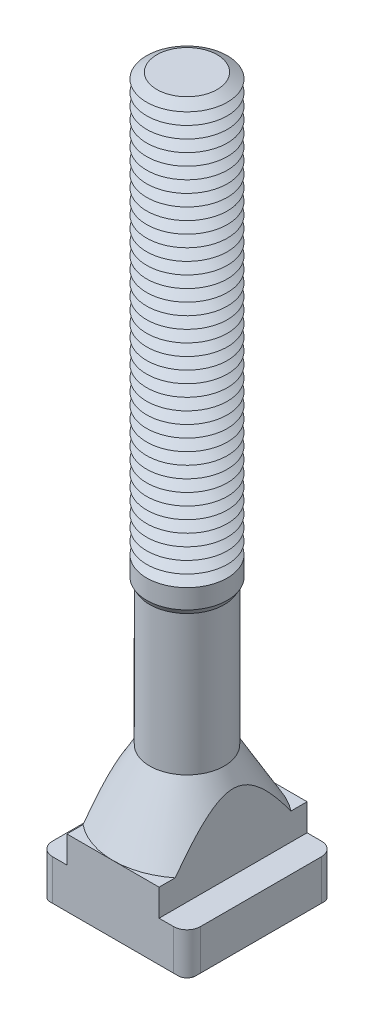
ISO-10303-21;
HEADER;
FILE_DESCRIPTION(('STEP AP214'),'2;1');
FILE_NAME('part.step','',(''),(''),'','','');
FILE_SCHEMA(('AUTOMOTIVE_DESIGN { 1 0 10303 214 1 1 1 1 }'));
ENDSEC;
DATA;
#1=APPLICATION_CONTEXT('core data for automotive mechanical design processes');
#2=APPLICATION_PROTOCOL_DEFINITION('international standard','automotive_design',2000,#1);
#3=PRODUCT_CONTEXT('',#1,'mechanical');
#4=PRODUCT('Part','Part','',(#3));
#5=PRODUCT_RELATED_PRODUCT_CATEGORY('part','',(#4));
#6=PRODUCT_DEFINITION_FORMATION('','',#4);
#7=PRODUCT_DEFINITION_CONTEXT('part definition',#1,'design');
#8=PRODUCT_DEFINITION('design','',#6,#7);
#9=PRODUCT_DEFINITION_SHAPE('','',#8);
#10=(LENGTH_UNIT() NAMED_UNIT(*) SI_UNIT(.MILLI.,.METRE.));
#11=(NAMED_UNIT(*) PLANE_ANGLE_UNIT() SI_UNIT($,.RADIAN.));
#12=(NAMED_UNIT(*) SI_UNIT($,.STERADIAN.) SOLID_ANGLE_UNIT());
#13=UNCERTAINTY_MEASURE_WITH_UNIT(LENGTH_MEASURE(1.E-05),#10,'distance_accuracy_value','');
#14=(GEOMETRIC_REPRESENTATION_CONTEXT(3) GLOBAL_UNCERTAINTY_ASSIGNED_CONTEXT((#13)) GLOBAL_UNIT_ASSIGNED_CONTEXT((#10,
#11,#12)) REPRESENTATION_CONTEXT('',''));
#15=CARTESIAN_POINT('',(0.,0.,0.));
#16=DIRECTION('',(0.,0.,1.));
#17=DIRECTION('',(1.,0.,0.));
#18=AXIS2_PLACEMENT_3D('',#15,#16,#17);
#19=CARTESIAN_POINT('',(0.,101.,0.));
#20=DIRECTION('',(0.,-1.,0.));
#21=DIRECTION('',(0.,0.,-1.));
#22=AXIS2_PLACEMENT_3D('',#19,#20,#21);
#23=CONICAL_SURFACE('',#22,4.48445554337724,1.0471975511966);
#24=CARTESIAN_POINT('',(0.,100.125,0.));
#25=DIRECTION('',(0.,-1.,0.));
#26=DIRECTION('',(0.,0.,-1.));
#27=AXIS2_PLACEMENT_3D('',#24,#25,#26);
#28=CIRCLE('',#27,6.);
#29=CARTESIAN_POINT('',(0.,100.125,-6.));
#30=VERTEX_POINT('',#29);
#31=EDGE_CURVE('E706',#30,#30,#28,.T.);
#32=ORIENTED_EDGE('',*,*,#31,.F.);
#33=EDGE_LOOP('',(#32));
#34=FACE_BOUND('',#33,.T.);
#35=CARTESIAN_POINT('',(0.,101.,0.));
#36=DIRECTION('',(0.,-1.,0.));
#37=DIRECTION('',(0.,0.,-1.));
#38=AXIS2_PLACEMENT_3D('',#35,#36,#37);
#39=CIRCLE('',#38,4.48445554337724);
#40=CARTESIAN_POINT('',(0.,101.,-4.48445554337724));
#41=VERTEX_POINT('',#40);
#42=EDGE_CURVE('E702',#41,#41,#39,.T.);
#43=ORIENTED_EDGE('',*,*,#42,.T.);
#44=EDGE_LOOP('',(#43));
#45=FACE_BOUND('',#44,.T.);
#46=ADVANCED_FACE('F38',(#34,#45),#23,.T.);
#47=CARTESIAN_POINT('',(0.,101.875,0.));
#48=DIRECTION('',(0.,1.,0.));
#49=DIRECTION('',(0.,0.,1.));
#50=AXIS2_PLACEMENT_3D('',#47,#48,#49);
#51=CONICAL_SURFACE('',#50,6.,1.0471975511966);
#52=ORIENTED_EDGE('',*,*,#42,.F.);
#53=EDGE_LOOP('',(#52));
#54=FACE_BOUND('',#53,.T.);
#55=CARTESIAN_POINT('',(0.,101.875,0.));
#56=DIRECTION('',(0.,-1.,0.));
#57=DIRECTION('',(0.,0.,-1.));
#58=AXIS2_PLACEMENT_3D('',#55,#56,#57);
#59=CIRCLE('',#58,6.);
#60=CARTESIAN_POINT('',(0.,101.875,-6.));
#61=VERTEX_POINT('',#60);
#62=EDGE_CURVE('E705',#61,#61,#59,.T.);
#63=ORIENTED_EDGE('',*,*,#62,.T.);
#64=EDGE_LOOP('',(#63));
#65=FACE_BOUND('',#64,.T.);
#66=ADVANCED_FACE('F447',(#54,#65),#51,.T.);
#67=CARTESIAN_POINT('',(2.99939673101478,108.,0.));
#68=DIRECTION('',(0.,-1.,0.));
#69=DIRECTION('',(1.,0.,0.));
#70=AXIS2_PLACEMENT_3D('',#67,#68,#69);
#71=PLANE('',#70);
#72=CARTESIAN_POINT('',(0.,108.,0.));
#73=DIRECTION('',(0.,-1.,0.));
#74=DIRECTION('',(0.,0.,-1.));
#75=AXIS2_PLACEMENT_3D('',#72,#73,#74);
#76=CIRCLE('',#75,4.48445554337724);
#77=CARTESIAN_POINT('',(0.,108.,-4.48445554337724));
#78=VERTEX_POINT('',#77);
#79=EDGE_CURVE('E699',#78,#78,#76,.T.);
#80=ORIENTED_EDGE('',*,*,#79,.F.);
#81=EDGE_LOOP('',(#80));
#82=FACE_BOUND('',#81,.T.);
#83=ADVANCED_FACE('F453',(#82),#71,.F.);
#84=CARTESIAN_POINT('',(0.,108.,0.));
#85=DIRECTION('',(0.,-1.,0.));
#86=DIRECTION('',(0.,0.,-1.));
#87=AXIS2_PLACEMENT_3D('',#84,#85,#86);
#88=CONICAL_SURFACE('',#87,4.48445554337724,1.0471975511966);
#89=CARTESIAN_POINT('',(0.,107.125,0.));
#90=DIRECTION('',(0.,-1.,0.));
#91=DIRECTION('',(0.,0.,-1.));
#92=AXIS2_PLACEMENT_3D('',#89,#90,#91);
#93=CIRCLE('',#92,6.);
#94=CARTESIAN_POINT('',(0.,107.125,-6.));
#95=VERTEX_POINT('',#94);
#96=EDGE_CURVE('E696',#95,#95,#93,.T.);
#97=ORIENTED_EDGE('',*,*,#96,.F.);
#98=EDGE_LOOP('',(#97));
#99=FACE_BOUND('',#98,.T.);
#100=ORIENTED_EDGE('',*,*,#79,.T.);
#101=EDGE_LOOP('',(#100));
#102=FACE_BOUND('',#101,.T.);
#103=ADVANCED_FACE('F481',(#99,#102),#88,.T.);
#104=CARTESIAN_POINT('',(0.,107.125,0.));
#105=DIRECTION('',(0.,1.,0.));
#106=DIRECTION('',(0.,0.,1.));
#107=AXIS2_PLACEMENT_3D('',#104,#105,#106);
#108=CONICAL_SURFACE('',#107,6.,1.0471975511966);
#109=CARTESIAN_POINT('',(0.,106.25,0.));
#110=DIRECTION('',(0.,-1.,0.));
#111=DIRECTION('',(0.,0.,-1.));
#112=AXIS2_PLACEMENT_3D('',#109,#110,#111);
#113=CIRCLE('',#112,4.48445554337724);
#114=CARTESIAN_POINT('',(0.,106.25,-4.48445554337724));
#115=VERTEX_POINT('',#114);
#116=EDGE_CURVE('E700',#115,#115,#113,.T.);
#117=ORIENTED_EDGE('',*,*,#116,.F.);
#118=EDGE_LOOP('',(#117));
#119=FACE_BOUND('',#118,.T.);
#120=ORIENTED_EDGE('',*,*,#96,.T.);
#121=EDGE_LOOP('',(#120));
#122=FACE_BOUND('',#121,.T.);
#123=ADVANCED_FACE('F478',(#119,#122),#108,.T.);
#124=CARTESIAN_POINT('',(0.,106.25,0.));
#125=DIRECTION('',(0.,-1.,0.));
#126=DIRECTION('',(0.,0.,-1.));
#127=AXIS2_PLACEMENT_3D('',#124,#125,#126);
#128=CONICAL_SURFACE('',#127,4.48445554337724,1.0471975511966);
#129=CARTESIAN_POINT('',(0.,105.375,0.));
#130=DIRECTION('',(0.,-1.,0.));
#131=DIRECTION('',(0.,0.,-1.));
#132=AXIS2_PLACEMENT_3D('',#129,#130,#131);
#133=CIRCLE('',#132,6.);
#134=CARTESIAN_POINT('',(0.,105.375,-6.));
#135=VERTEX_POINT('',#134);
#136=EDGE_CURVE('E651',#135,#135,#133,.T.);
#137=ORIENTED_EDGE('',*,*,#136,.F.);
#138=EDGE_LOOP('',(#137));
#139=FACE_BOUND('',#138,.T.);
#140=ORIENTED_EDGE('',*,*,#116,.T.);
#141=EDGE_LOOP('',(#140));
#142=FACE_BOUND('',#141,.T.);
#143=ADVANCED_FACE('F473',(#139,#142),#128,.T.);
#144=CARTESIAN_POINT('',(0.,105.375,0.));
#145=DIRECTION('',(0.,1.,0.));
#146=DIRECTION('',(0.,0.,1.));
#147=AXIS2_PLACEMENT_3D('',#144,#145,#146);
#148=CONICAL_SURFACE('',#147,6.,1.0471975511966);
#149=CARTESIAN_POINT('',(0.,104.5,0.));
#150=DIRECTION('',(0.,-1.,0.));
#151=DIRECTION('',(0.,0.,-1.));
#152=AXIS2_PLACEMENT_3D('',#149,#150,#151);
#153=CIRCLE('',#152,4.48445554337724);
#154=CARTESIAN_POINT('',(0.,104.5,-4.48445554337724));
#155=VERTEX_POINT('',#154);
#156=EDGE_CURVE('E649',#155,#155,#153,.T.);
#157=ORIENTED_EDGE('',*,*,#156,.F.);
#158=EDGE_LOOP('',(#157));
#159=FACE_BOUND('',#158,.T.);
#160=ORIENTED_EDGE('',*,*,#136,.T.);
#161=EDGE_LOOP('',(#160));
#162=FACE_BOUND('',#161,.T.);
#163=ADVANCED_FACE('F470',(#159,#162),#148,.T.);
#164=CARTESIAN_POINT('',(0.,104.5,0.));
#165=DIRECTION('',(0.,-1.,0.));
#166=DIRECTION('',(0.,0.,-1.));
#167=AXIS2_PLACEMENT_3D('',#164,#165,#166);
#168=CONICAL_SURFACE('',#167,4.48445554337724,1.0471975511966);
#169=CARTESIAN_POINT('',(0.,103.625,0.));
#170=DIRECTION('',(0.,-1.,0.));
#171=DIRECTION('',(0.,0.,-1.));
#172=AXIS2_PLACEMENT_3D('',#169,#170,#171);
#173=CIRCLE('',#172,6.);
#174=CARTESIAN_POINT('',(0.,103.625,-6.));
#175=VERTEX_POINT('',#174);
#176=EDGE_CURVE('E652',#175,#175,#173,.T.);
#177=ORIENTED_EDGE('',*,*,#176,.F.);
#178=EDGE_LOOP('',(#177));
#179=FACE_BOUND('',#178,.T.);
#180=ORIENTED_EDGE('',*,*,#156,.T.);
#181=EDGE_LOOP('',(#180));
#182=FACE_BOUND('',#181,.T.);
#183=ADVANCED_FACE('F464',(#179,#182),#168,.T.);
#184=CARTESIAN_POINT('',(0.,103.625,0.));
#185=DIRECTION('',(0.,1.,0.));
#186=DIRECTION('',(0.,0.,1.));
#187=AXIS2_PLACEMENT_3D('',#184,#185,#186);
#188=CONICAL_SURFACE('',#187,6.,1.0471975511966);
#189=CARTESIAN_POINT('',(0.,102.75,0.));
#190=DIRECTION('',(0.,-1.,0.));
#191=DIRECTION('',(0.,0.,-1.));
#192=AXIS2_PLACEMENT_3D('',#189,#190,#191);
#193=CIRCLE('',#192,4.48445554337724);
#194=CARTESIAN_POINT('',(0.,102.75,-4.48445554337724));
#195=VERTEX_POINT('',#194);
#196=EDGE_CURVE('E672',#195,#195,#193,.T.);
#197=ORIENTED_EDGE('',*,*,#196,.F.);
#198=EDGE_LOOP('',(#197));
#199=FACE_BOUND('',#198,.T.);
#200=ORIENTED_EDGE('',*,*,#176,.T.);
#201=EDGE_LOOP('',(#200));
#202=FACE_BOUND('',#201,.T.);
#203=ADVANCED_FACE('F460',(#199,#202),#188,.T.);
#204=CARTESIAN_POINT('',(0.,102.75,0.));
#205=DIRECTION('',(0.,-1.,0.));
#206=DIRECTION('',(0.,0.,-1.));
#207=AXIS2_PLACEMENT_3D('',#204,#205,#206);
#208=CONICAL_SURFACE('',#207,4.48445554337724,1.0471975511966);
#209=ORIENTED_EDGE('',*,*,#62,.F.);
#210=EDGE_LOOP('',(#209));
#211=FACE_BOUND('',#210,.T.);
#212=ORIENTED_EDGE('',*,*,#196,.T.);
#213=EDGE_LOOP('',(#212));
#214=FACE_BOUND('',#213,.T.);
#215=ADVANCED_FACE('F463',(#211,#214),#208,.T.);
#216=CARTESIAN_POINT('',(0.,99.25,0.));
#217=DIRECTION('',(0.,-1.,0.));
#218=DIRECTION('',(0.,0.,-1.));
#219=AXIS2_PLACEMENT_3D('',#216,#217,#218);
#220=CONICAL_SURFACE('',#219,4.48445554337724,1.0471975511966);
#221=CARTESIAN_POINT('',(0.,98.375,0.));
#222=DIRECTION('',(0.,-1.,0.));
#223=DIRECTION('',(0.,0.,-1.));
#224=AXIS2_PLACEMENT_3D('',#221,#222,#223);
#225=CIRCLE('',#224,6.);
#226=CARTESIAN_POINT('',(0.,98.375,-6.));
#227=VERTEX_POINT('',#226);
#228=EDGE_CURVE('E646',#227,#227,#225,.T.);
#229=ORIENTED_EDGE('',*,*,#228,.F.);
#230=EDGE_LOOP('',(#229));
#231=FACE_BOUND('',#230,.T.);
#232=CARTESIAN_POINT('',(0.,99.25,0.));
#233=DIRECTION('',(0.,-1.,0.));
#234=DIRECTION('',(0.,0.,-1.));
#235=AXIS2_PLACEMENT_3D('',#232,#233,#234);
#236=CIRCLE('',#235,4.48445554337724);
#237=CARTESIAN_POINT('',(0.,99.25,-4.48445554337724));
#238=VERTEX_POINT('',#237);
#239=EDGE_CURVE('E840',#238,#238,#236,.T.);
#240=ORIENTED_EDGE('',*,*,#239,.T.);
#241=EDGE_LOOP('',(#240));
#242=FACE_BOUND('',#241,.T.);
#243=ADVANCED_FACE('F468',(#231,#242),#220,.T.);
#244=CARTESIAN_POINT('',(0.,100.125,0.));
#245=DIRECTION('',(0.,1.,0.));
#246=DIRECTION('',(0.,0.,1.));
#247=AXIS2_PLACEMENT_3D('',#244,#245,#246);
#248=CONICAL_SURFACE('',#247,6.,1.0471975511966);
#249=ORIENTED_EDGE('',*,*,#239,.F.);
#250=EDGE_LOOP('',(#249));
#251=FACE_BOUND('',#250,.T.);
#252=ORIENTED_EDGE('',*,*,#31,.T.);
#253=EDGE_LOOP('',(#252));
#254=FACE_BOUND('',#253,.T.);
#255=ADVANCED_FACE('F1596',(#251,#254),#248,.T.);
#256=CARTESIAN_POINT('',(0.,97.5,0.));
#257=DIRECTION('',(0.,-1.,0.));
#258=DIRECTION('',(0.,0.,-1.));
#259=AXIS2_PLACEMENT_3D('',#256,#257,#258);
#260=CONICAL_SURFACE('',#259,4.48445554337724,1.0471975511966);
#261=CARTESIAN_POINT('',(0.,96.625,0.));
#262=DIRECTION('',(0.,-1.,0.));
#263=DIRECTION('',(0.,0.,-1.));
#264=AXIS2_PLACEMENT_3D('',#261,#262,#263);
#265=CIRCLE('',#264,6.);
#266=CARTESIAN_POINT('',(0.,96.625,-6.));
#267=VERTEX_POINT('',#266);
#268=EDGE_CURVE('E647',#267,#267,#265,.T.);
#269=ORIENTED_EDGE('',*,*,#268,.F.);
#270=EDGE_LOOP('',(#269));
#271=FACE_BOUND('',#270,.T.);
#272=CARTESIAN_POINT('',(0.,97.5,0.));
#273=DIRECTION('',(0.,-1.,0.));
#274=DIRECTION('',(0.,0.,-1.));
#275=AXIS2_PLACEMENT_3D('',#272,#273,#274);
#276=CIRCLE('',#275,4.48445554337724);
#277=CARTESIAN_POINT('',(0.,97.5,-4.48445554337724));
#278=VERTEX_POINT('',#277);
#279=EDGE_CURVE('E643',#278,#278,#276,.T.);
#280=ORIENTED_EDGE('',*,*,#279,.T.);
#281=EDGE_LOOP('',(#280));
#282=FACE_BOUND('',#281,.T.);
#283=ADVANCED_FACE('F1586',(#271,#282),#260,.T.);
#284=CARTESIAN_POINT('',(0.,98.375,0.));
#285=DIRECTION('',(0.,1.,0.));
#286=DIRECTION('',(0.,0.,1.));
#287=AXIS2_PLACEMENT_3D('',#284,#285,#286);
#288=CONICAL_SURFACE('',#287,6.,1.0471975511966);
#289=ORIENTED_EDGE('',*,*,#279,.F.);
#290=EDGE_LOOP('',(#289));
#291=FACE_BOUND('',#290,.T.);
#292=ORIENTED_EDGE('',*,*,#228,.T.);
#293=EDGE_LOOP('',(#292));
#294=FACE_BOUND('',#293,.T.);
#295=ADVANCED_FACE('F1576',(#291,#294),#288,.T.);
#296=CARTESIAN_POINT('',(0.,95.75,0.));
#297=DIRECTION('',(0.,-1.,0.));
#298=DIRECTION('',(0.,0.,-1.));
#299=AXIS2_PLACEMENT_3D('',#296,#297,#298);
#300=CONICAL_SURFACE('',#299,4.48445554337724,1.0471975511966);
#301=CARTESIAN_POINT('',(0.,94.875,0.));
#302=DIRECTION('',(0.,-1.,0.));
#303=DIRECTION('',(0.,0.,-1.));
#304=AXIS2_PLACEMENT_3D('',#301,#302,#303);
#305=CIRCLE('',#304,6.);
#306=CARTESIAN_POINT('',(0.,94.875,-6.));
#307=VERTEX_POINT('',#306);
#308=EDGE_CURVE('E763',#307,#307,#305,.T.);
#309=ORIENTED_EDGE('',*,*,#308,.F.);
#310=EDGE_LOOP('',(#309));
#311=FACE_BOUND('',#310,.T.);
#312=CARTESIAN_POINT('',(0.,95.75,0.));
#313=DIRECTION('',(0.,-1.,0.));
#314=DIRECTION('',(0.,0.,-1.));
#315=AXIS2_PLACEMENT_3D('',#312,#313,#314);
#316=CIRCLE('',#315,4.48445554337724);
#317=CARTESIAN_POINT('',(0.,95.75,-4.48445554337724));
#318=VERTEX_POINT('',#317);
#319=EDGE_CURVE('E669',#318,#318,#316,.T.);
#320=ORIENTED_EDGE('',*,*,#319,.T.);
#321=EDGE_LOOP('',(#320));
#322=FACE_BOUND('',#321,.T.);
#323=ADVANCED_FACE('F1566',(#311,#322),#300,.T.);
#324=CARTESIAN_POINT('',(0.,96.625,0.));
#325=DIRECTION('',(0.,1.,0.));
#326=DIRECTION('',(0.,0.,1.));
#327=AXIS2_PLACEMENT_3D('',#324,#325,#326);
#328=CONICAL_SURFACE('',#327,6.,1.0471975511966);
#329=ORIENTED_EDGE('',*,*,#319,.F.);
#330=EDGE_LOOP('',(#329));
#331=FACE_BOUND('',#330,.T.);
#332=ORIENTED_EDGE('',*,*,#268,.T.);
#333=EDGE_LOOP('',(#332));
#334=FACE_BOUND('',#333,.T.);
#335=ADVANCED_FACE('F1556',(#331,#334),#328,.T.);
#336=CARTESIAN_POINT('',(0.,94.,0.));
#337=DIRECTION('',(0.,-1.,0.));
#338=DIRECTION('',(0.,0.,-1.));
#339=AXIS2_PLACEMENT_3D('',#336,#337,#338);
#340=CONICAL_SURFACE('',#339,4.48445554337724,1.0471975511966);
#341=CARTESIAN_POINT('',(0.,93.125,0.));
#342=DIRECTION('',(0.,-1.,0.));
#343=DIRECTION('',(0.,0.,-1.));
#344=AXIS2_PLACEMENT_3D('',#341,#342,#343);
#345=CIRCLE('',#344,6.);
#346=CARTESIAN_POINT('',(0.,93.125,-6.));
#347=VERTEX_POINT('',#346);
#348=EDGE_CURVE('E775',#347,#347,#345,.T.);
#349=ORIENTED_EDGE('',*,*,#348,.F.);
#350=EDGE_LOOP('',(#349));
#351=FACE_BOUND('',#350,.T.);
#352=CARTESIAN_POINT('',(0.,94.,0.));
#353=DIRECTION('',(0.,-1.,0.));
#354=DIRECTION('',(0.,0.,-1.));
#355=AXIS2_PLACEMENT_3D('',#352,#353,#354);
#356=CIRCLE('',#355,4.48445554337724);
#357=CARTESIAN_POINT('',(0.,94.,-4.48445554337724));
#358=VERTEX_POINT('',#357);
#359=EDGE_CURVE('E773',#358,#358,#356,.T.);
#360=ORIENTED_EDGE('',*,*,#359,.T.);
#361=EDGE_LOOP('',(#360));
#362=FACE_BOUND('',#361,.T.);
#363=ADVANCED_FACE('F1546',(#351,#362),#340,.T.);
#364=CARTESIAN_POINT('',(0.,94.875,0.));
#365=DIRECTION('',(0.,1.,0.));
#366=DIRECTION('',(0.,0.,1.));
#367=AXIS2_PLACEMENT_3D('',#364,#365,#366);
#368=CONICAL_SURFACE('',#367,6.,1.0471975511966);
#369=ORIENTED_EDGE('',*,*,#359,.F.);
#370=EDGE_LOOP('',(#369));
#371=FACE_BOUND('',#370,.T.);
#372=ORIENTED_EDGE('',*,*,#308,.T.);
#373=EDGE_LOOP('',(#372));
#374=FACE_BOUND('',#373,.T.);
#375=ADVANCED_FACE('F1536',(#371,#374),#368,.T.);
#376=CARTESIAN_POINT('',(0.,92.25,0.));
#377=DIRECTION('',(0.,-1.,0.));
#378=DIRECTION('',(0.,0.,-1.));
#379=AXIS2_PLACEMENT_3D('',#376,#377,#378);
#380=CONICAL_SURFACE('',#379,4.48445554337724,1.0471975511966);
#381=CARTESIAN_POINT('',(0.,91.375,0.));
#382=DIRECTION('',(0.,-1.,0.));
#383=DIRECTION('',(0.,0.,-1.));
#384=AXIS2_PLACEMENT_3D('',#381,#382,#383);
#385=CIRCLE('',#384,6.);
#386=CARTESIAN_POINT('',(0.,91.375,-6.));
#387=VERTEX_POINT('',#386);
#388=EDGE_CURVE('E824',#387,#387,#385,.T.);
#389=ORIENTED_EDGE('',*,*,#388,.F.);
#390=EDGE_LOOP('',(#389));
#391=FACE_BOUND('',#390,.T.);
#392=CARTESIAN_POINT('',(0.,92.25,0.));
#393=DIRECTION('',(0.,-1.,0.));
#394=DIRECTION('',(0.,0.,-1.));
#395=AXIS2_PLACEMENT_3D('',#392,#393,#394);
#396=CIRCLE('',#395,4.48445554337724);
#397=CARTESIAN_POINT('',(0.,92.25,-4.48445554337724));
#398=VERTEX_POINT('',#397);
#399=EDGE_CURVE('E815',#398,#398,#396,.T.);
#400=ORIENTED_EDGE('',*,*,#399,.T.);
#401=EDGE_LOOP('',(#400));
#402=FACE_BOUND('',#401,.T.);
#403=ADVANCED_FACE('F1526',(#391,#402),#380,.T.);
#404=CARTESIAN_POINT('',(0.,93.125,0.));
#405=DIRECTION('',(0.,1.,0.));
#406=DIRECTION('',(0.,0.,1.));
#407=AXIS2_PLACEMENT_3D('',#404,#405,#406);
#408=CONICAL_SURFACE('',#407,6.,1.0471975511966);
#409=ORIENTED_EDGE('',*,*,#399,.F.);
#410=EDGE_LOOP('',(#409));
#411=FACE_BOUND('',#410,.T.);
#412=ORIENTED_EDGE('',*,*,#348,.T.);
#413=EDGE_LOOP('',(#412));
#414=FACE_BOUND('',#413,.T.);
#415=ADVANCED_FACE('F1516',(#411,#414),#408,.T.);
#416=CARTESIAN_POINT('',(0.,90.5,0.));
#417=DIRECTION('',(0.,-1.,0.));
#418=DIRECTION('',(0.,0.,-1.));
#419=AXIS2_PLACEMENT_3D('',#416,#417,#418);
#420=CONICAL_SURFACE('',#419,4.48445554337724,1.0471975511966);
#421=CARTESIAN_POINT('',(0.,89.625,0.));
#422=DIRECTION('',(0.,-1.,0.));
#423=DIRECTION('',(0.,0.,-1.));
#424=AXIS2_PLACEMENT_3D('',#421,#422,#423);
#425=CIRCLE('',#424,6.);
#426=CARTESIAN_POINT('',(0.,89.625,-6.));
#427=VERTEX_POINT('',#426);
#428=EDGE_CURVE('E727',#427,#427,#425,.T.);
#429=ORIENTED_EDGE('',*,*,#428,.F.);
#430=EDGE_LOOP('',(#429));
#431=FACE_BOUND('',#430,.T.);
#432=CARTESIAN_POINT('',(0.,90.5,0.));
#433=DIRECTION('',(0.,-1.,0.));
#434=DIRECTION('',(0.,0.,-1.));
#435=AXIS2_PLACEMENT_3D('',#432,#433,#434);
#436=CIRCLE('',#435,4.48445554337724);
#437=CARTESIAN_POINT('',(0.,90.5,-4.48445554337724));
#438=VERTEX_POINT('',#437);
#439=EDGE_CURVE('E730',#438,#438,#436,.T.);
#440=ORIENTED_EDGE('',*,*,#439,.T.);
#441=EDGE_LOOP('',(#440));
#442=FACE_BOUND('',#441,.T.);
#443=ADVANCED_FACE('F1506',(#431,#442),#420,.T.);
#444=CARTESIAN_POINT('',(0.,91.375,0.));
#445=DIRECTION('',(0.,1.,0.));
#446=DIRECTION('',(0.,0.,1.));
#447=AXIS2_PLACEMENT_3D('',#444,#445,#446);
#448=CONICAL_SURFACE('',#447,6.,1.0471975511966);
#449=ORIENTED_EDGE('',*,*,#439,.F.);
#450=EDGE_LOOP('',(#449));
#451=FACE_BOUND('',#450,.T.);
#452=ORIENTED_EDGE('',*,*,#388,.T.);
#453=EDGE_LOOP('',(#452));
#454=FACE_BOUND('',#453,.T.);
#455=ADVANCED_FACE('F1496',(#451,#454),#448,.T.);
#456=CARTESIAN_POINT('',(0.,88.75,0.));
#457=DIRECTION('',(0.,-1.,0.));
#458=DIRECTION('',(0.,0.,-1.));
#459=AXIS2_PLACEMENT_3D('',#456,#457,#458);
#460=CONICAL_SURFACE('',#459,4.48445554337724,1.0471975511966);
#461=CARTESIAN_POINT('',(0.,87.875,0.));
#462=DIRECTION('',(0.,-1.,0.));
#463=DIRECTION('',(0.,0.,-1.));
#464=AXIS2_PLACEMENT_3D('',#461,#462,#463);
#465=CIRCLE('',#464,6.);
#466=CARTESIAN_POINT('',(0.,87.875,-6.));
#467=VERTEX_POINT('',#466);
#468=EDGE_CURVE('E759',#467,#467,#465,.T.);
#469=ORIENTED_EDGE('',*,*,#468,.F.);
#470=EDGE_LOOP('',(#469));
#471=FACE_BOUND('',#470,.T.);
#472=CARTESIAN_POINT('',(0.,88.75,0.));
#473=DIRECTION('',(0.,-1.,0.));
#474=DIRECTION('',(0.,0.,-1.));
#475=AXIS2_PLACEMENT_3D('',#472,#473,#474);
#476=CIRCLE('',#475,4.48445554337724);
#477=CARTESIAN_POINT('',(0.,88.75,-4.48445554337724));
#478=VERTEX_POINT('',#477);
#479=EDGE_CURVE('E731',#478,#478,#476,.T.);
#480=ORIENTED_EDGE('',*,*,#479,.T.);
#481=EDGE_LOOP('',(#480));
#482=FACE_BOUND('',#481,.T.);
#483=ADVANCED_FACE('F1486',(#471,#482),#460,.T.);
#484=CARTESIAN_POINT('',(0.,89.625,0.));
#485=DIRECTION('',(0.,1.,0.));
#486=DIRECTION('',(0.,0.,1.));
#487=AXIS2_PLACEMENT_3D('',#484,#485,#486);
#488=CONICAL_SURFACE('',#487,6.,1.0471975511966);
#489=ORIENTED_EDGE('',*,*,#479,.F.);
#490=EDGE_LOOP('',(#489));
#491=FACE_BOUND('',#490,.T.);
#492=ORIENTED_EDGE('',*,*,#428,.T.);
#493=EDGE_LOOP('',(#492));
#494=FACE_BOUND('',#493,.T.);
#495=ADVANCED_FACE('F1476',(#491,#494),#488,.T.);
#496=CARTESIAN_POINT('',(0.,87.,0.));
#497=DIRECTION('',(0.,-1.,0.));
#498=DIRECTION('',(0.,0.,-1.));
#499=AXIS2_PLACEMENT_3D('',#496,#497,#498);
#500=CONICAL_SURFACE('',#499,4.48445554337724,1.0471975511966);
#501=CARTESIAN_POINT('',(0.,86.125,0.));
#502=DIRECTION('',(0.,-1.,0.));
#503=DIRECTION('',(0.,0.,-1.));
#504=AXIS2_PLACEMENT_3D('',#501,#502,#503);
#505=CIRCLE('',#504,6.);
#506=CARTESIAN_POINT('',(0.,86.125,-6.));
#507=VERTEX_POINT('',#506);
#508=EDGE_CURVE('E661',#507,#507,#505,.T.);
#509=ORIENTED_EDGE('',*,*,#508,.F.);
#510=EDGE_LOOP('',(#509));
#511=FACE_BOUND('',#510,.T.);
#512=CARTESIAN_POINT('',(0.,87.,0.));
#513=DIRECTION('',(0.,-1.,0.));
#514=DIRECTION('',(0.,0.,-1.));
#515=AXIS2_PLACEMENT_3D('',#512,#513,#514);
#516=CIRCLE('',#515,4.48445554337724);
#517=CARTESIAN_POINT('',(0.,87.,-4.48445554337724));
#518=VERTEX_POINT('',#517);
#519=EDGE_CURVE('E664',#518,#518,#516,.T.);
#520=ORIENTED_EDGE('',*,*,#519,.T.);
#521=EDGE_LOOP('',(#520));
#522=FACE_BOUND('',#521,.T.);
#523=ADVANCED_FACE('F1466',(#511,#522),#500,.T.);
#524=CARTESIAN_POINT('',(0.,87.875,0.));
#525=DIRECTION('',(0.,1.,0.));
#526=DIRECTION('',(0.,0.,1.));
#527=AXIS2_PLACEMENT_3D('',#524,#525,#526);
#528=CONICAL_SURFACE('',#527,6.,1.0471975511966);
#529=ORIENTED_EDGE('',*,*,#519,.F.);
#530=EDGE_LOOP('',(#529));
#531=FACE_BOUND('',#530,.T.);
#532=ORIENTED_EDGE('',*,*,#468,.T.);
#533=EDGE_LOOP('',(#532));
#534=FACE_BOUND('',#533,.T.);
#535=ADVANCED_FACE('F1456',(#531,#534),#528,.T.);
#536=CARTESIAN_POINT('',(0.,85.25,0.));
#537=DIRECTION('',(0.,-1.,0.));
#538=DIRECTION('',(0.,0.,-1.));
#539=AXIS2_PLACEMENT_3D('',#536,#537,#538);
#540=CONICAL_SURFACE('',#539,4.48445554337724,1.0471975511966);
#541=CARTESIAN_POINT('',(0.,84.375,0.));
#542=DIRECTION('',(0.,-1.,0.));
#543=DIRECTION('',(0.,0.,-1.));
#544=AXIS2_PLACEMENT_3D('',#541,#542,#543);
#545=CIRCLE('',#544,6.);
#546=CARTESIAN_POINT('',(0.,84.375,-6.));
#547=VERTEX_POINT('',#546);
#548=EDGE_CURVE('E809',#547,#547,#545,.T.);
#549=ORIENTED_EDGE('',*,*,#548,.F.);
#550=EDGE_LOOP('',(#549));
#551=FACE_BOUND('',#550,.T.);
#552=CARTESIAN_POINT('',(0.,85.25,0.));
#553=DIRECTION('',(0.,-1.,0.));
#554=DIRECTION('',(0.,0.,-1.));
#555=AXIS2_PLACEMENT_3D('',#552,#553,#554);
#556=CIRCLE('',#555,4.48445554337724);
#557=CARTESIAN_POINT('',(0.,85.25,-4.48445554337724));
#558=VERTEX_POINT('',#557);
#559=EDGE_CURVE('E665',#558,#558,#556,.T.);
#560=ORIENTED_EDGE('',*,*,#559,.T.);
#561=EDGE_LOOP('',(#560));
#562=FACE_BOUND('',#561,.T.);
#563=ADVANCED_FACE('F1446',(#551,#562),#540,.T.);
#564=CARTESIAN_POINT('',(0.,86.125,0.));
#565=DIRECTION('',(0.,1.,0.));
#566=DIRECTION('',(0.,0.,1.));
#567=AXIS2_PLACEMENT_3D('',#564,#565,#566);
#568=CONICAL_SURFACE('',#567,6.,1.0471975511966);
#569=ORIENTED_EDGE('',*,*,#559,.F.);
#570=EDGE_LOOP('',(#569));
#571=FACE_BOUND('',#570,.T.);
#572=ORIENTED_EDGE('',*,*,#508,.T.);
#573=EDGE_LOOP('',(#572));
#574=FACE_BOUND('',#573,.T.);
#575=ADVANCED_FACE('F1436',(#571,#574),#568,.T.);
#576=CARTESIAN_POINT('',(0.,83.5,0.));
#577=DIRECTION('',(0.,-1.,0.));
#578=DIRECTION('',(0.,0.,-1.));
#579=AXIS2_PLACEMENT_3D('',#576,#577,#578);
#580=CONICAL_SURFACE('',#579,4.48445554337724,1.0471975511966);
#581=CARTESIAN_POINT('',(0.,82.625,0.));
#582=DIRECTION('',(0.,-1.,0.));
#583=DIRECTION('',(0.,0.,-1.));
#584=AXIS2_PLACEMENT_3D('',#581,#582,#583);
#585=CIRCLE('',#584,6.);
#586=CARTESIAN_POINT('',(0.,82.625,-6.));
#587=VERTEX_POINT('',#586);
#588=EDGE_CURVE('E755',#587,#587,#585,.T.);
#589=ORIENTED_EDGE('',*,*,#588,.F.);
#590=EDGE_LOOP('',(#589));
#591=FACE_BOUND('',#590,.T.);
#592=CARTESIAN_POINT('',(0.,83.5,0.));
#593=DIRECTION('',(0.,-1.,0.));
#594=DIRECTION('',(0.,0.,-1.));
#595=AXIS2_PLACEMENT_3D('',#592,#593,#594);
#596=CIRCLE('',#595,4.48445554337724);
#597=CARTESIAN_POINT('',(0.,83.5,-4.48445554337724));
#598=VERTEX_POINT('',#597);
#599=EDGE_CURVE('E812',#598,#598,#596,.T.);
#600=ORIENTED_EDGE('',*,*,#599,.T.);
#601=EDGE_LOOP('',(#600));
#602=FACE_BOUND('',#601,.T.);
#603=ADVANCED_FACE('F1426',(#591,#602),#580,.T.);
#604=CARTESIAN_POINT('',(0.,84.375,0.));
#605=DIRECTION('',(0.,1.,0.));
#606=DIRECTION('',(0.,0.,1.));
#607=AXIS2_PLACEMENT_3D('',#604,#605,#606);
#608=CONICAL_SURFACE('',#607,6.,1.0471975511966);
#609=ORIENTED_EDGE('',*,*,#599,.F.);
#610=EDGE_LOOP('',(#609));
#611=FACE_BOUND('',#610,.T.);
#612=ORIENTED_EDGE('',*,*,#548,.T.);
#613=EDGE_LOOP('',(#612));
#614=FACE_BOUND('',#613,.T.);
#615=ADVANCED_FACE('F1416',(#611,#614),#608,.T.);
#616=CARTESIAN_POINT('',(0.,81.75,0.));
#617=DIRECTION('',(0.,-1.,0.));
#618=DIRECTION('',(0.,0.,-1.));
#619=AXIS2_PLACEMENT_3D('',#616,#617,#618);
#620=CONICAL_SURFACE('',#619,4.48445554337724,1.0471975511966);
#621=CARTESIAN_POINT('',(0.,80.875,0.));
#622=DIRECTION('',(0.,-1.,0.));
#623=DIRECTION('',(0.,0.,-1.));
#624=AXIS2_PLACEMENT_3D('',#621,#622,#623);
#625=CIRCLE('',#624,6.);
#626=CARTESIAN_POINT('',(0.,80.875,-6.));
#627=VERTEX_POINT('',#626);
#628=EDGE_CURVE('E725',#627,#627,#625,.T.);
#629=ORIENTED_EDGE('',*,*,#628,.F.);
#630=EDGE_LOOP('',(#629));
#631=FACE_BOUND('',#630,.T.);
#632=CARTESIAN_POINT('',(0.,81.75,0.));
#633=DIRECTION('',(0.,-1.,0.));
#634=DIRECTION('',(0.,0.,-1.));
#635=AXIS2_PLACEMENT_3D('',#632,#633,#634);
#636=CIRCLE('',#635,4.48445554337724);
#637=CARTESIAN_POINT('',(0.,81.75,-4.48445554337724));
#638=VERTEX_POINT('',#637);
#639=EDGE_CURVE('E752',#638,#638,#636,.T.);
#640=ORIENTED_EDGE('',*,*,#639,.T.);
#641=EDGE_LOOP('',(#640));
#642=FACE_BOUND('',#641,.T.);
#643=ADVANCED_FACE('F1406',(#631,#642),#620,.T.);
#644=CARTESIAN_POINT('',(0.,82.625,0.));
#645=DIRECTION('',(0.,1.,0.));
#646=DIRECTION('',(0.,0.,1.));
#647=AXIS2_PLACEMENT_3D('',#644,#645,#646);
#648=CONICAL_SURFACE('',#647,6.,1.0471975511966);
#649=ORIENTED_EDGE('',*,*,#639,.F.);
#650=EDGE_LOOP('',(#649));
#651=FACE_BOUND('',#650,.T.);
#652=ORIENTED_EDGE('',*,*,#588,.T.);
#653=EDGE_LOOP('',(#652));
#654=FACE_BOUND('',#653,.T.);
#655=ADVANCED_FACE('F1396',(#651,#654),#648,.T.);
#656=CARTESIAN_POINT('',(0.,80.,0.));
#657=DIRECTION('',(0.,-1.,0.));
#658=DIRECTION('',(0.,0.,-1.));
#659=AXIS2_PLACEMENT_3D('',#656,#657,#658);
#660=CONICAL_SURFACE('',#659,4.48445554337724,1.0471975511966);
#661=CARTESIAN_POINT('',(0.,79.125,0.));
#662=DIRECTION('',(0.,-1.,0.));
#663=DIRECTION('',(0.,0.,-1.));
#664=AXIS2_PLACEMENT_3D('',#661,#662,#663);
#665=CIRCLE('',#664,6.);
#666=CARTESIAN_POINT('',(0.,79.125,-6.));
#667=VERTEX_POINT('',#666);
#668=EDGE_CURVE('E719',#667,#667,#665,.T.);
#669=ORIENTED_EDGE('',*,*,#668,.F.);
#670=EDGE_LOOP('',(#669));
#671=FACE_BOUND('',#670,.T.);
#672=CARTESIAN_POINT('',(0.,80.,0.));
#673=DIRECTION('',(0.,-1.,0.));
#674=DIRECTION('',(0.,0.,-1.));
#675=AXIS2_PLACEMENT_3D('',#672,#673,#674);
#676=CIRCLE('',#675,4.48445554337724);
#677=CARTESIAN_POINT('',(0.,80.,-4.48445554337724));
#678=VERTEX_POINT('',#677);
#679=EDGE_CURVE('E722',#678,#678,#676,.T.);
#680=ORIENTED_EDGE('',*,*,#679,.T.);
#681=EDGE_LOOP('',(#680));
#682=FACE_BOUND('',#681,.T.);
#683=ADVANCED_FACE('F1386',(#671,#682),#660,.T.);
#684=CARTESIAN_POINT('',(0.,80.875,0.));
#685=DIRECTION('',(0.,1.,0.));
#686=DIRECTION('',(0.,0.,1.));
#687=AXIS2_PLACEMENT_3D('',#684,#685,#686);
#688=CONICAL_SURFACE('',#687,6.,1.0471975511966);
#689=ORIENTED_EDGE('',*,*,#679,.F.);
#690=EDGE_LOOP('',(#689));
#691=FACE_BOUND('',#690,.T.);
#692=ORIENTED_EDGE('',*,*,#628,.T.);
#693=EDGE_LOOP('',(#692));
#694=FACE_BOUND('',#693,.T.);
#695=ADVANCED_FACE('F1376',(#691,#694),#688,.T.);
#696=CARTESIAN_POINT('',(0.,78.25,0.));
#697=DIRECTION('',(0.,-1.,0.));
#698=DIRECTION('',(0.,0.,-1.));
#699=AXIS2_PLACEMENT_3D('',#696,#697,#698);
#700=CONICAL_SURFACE('',#699,4.48445554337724,1.0471975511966);
#701=CARTESIAN_POINT('',(0.,77.375,0.));
#702=DIRECTION('',(0.,-1.,0.));
#703=DIRECTION('',(0.,0.,-1.));
#704=AXIS2_PLACEMENT_3D('',#701,#702,#703);
#705=CIRCLE('',#704,6.);
#706=CARTESIAN_POINT('',(0.,77.375,-6.));
#707=VERTEX_POINT('',#706);
#708=EDGE_CURVE('E720',#707,#707,#705,.T.);
#709=ORIENTED_EDGE('',*,*,#708,.F.);
#710=EDGE_LOOP('',(#709));
#711=FACE_BOUND('',#710,.T.);
#712=CARTESIAN_POINT('',(0.,78.25,0.));
#713=DIRECTION('',(0.,-1.,0.));
#714=DIRECTION('',(0.,0.,-1.));
#715=AXIS2_PLACEMENT_3D('',#712,#713,#714);
#716=CIRCLE('',#715,4.48445554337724);
#717=CARTESIAN_POINT('',(0.,78.25,-4.48445554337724));
#718=VERTEX_POINT('',#717);
#719=EDGE_CURVE('E716',#718,#718,#716,.T.);
#720=ORIENTED_EDGE('',*,*,#719,.T.);
#721=EDGE_LOOP('',(#720));
#722=FACE_BOUND('',#721,.T.);
#723=ADVANCED_FACE('F1366',(#711,#722),#700,.T.);
#724=CARTESIAN_POINT('',(0.,79.125,0.));
#725=DIRECTION('',(0.,1.,0.));
#726=DIRECTION('',(0.,0.,1.));
#727=AXIS2_PLACEMENT_3D('',#724,#725,#726);
#728=CONICAL_SURFACE('',#727,6.,1.0471975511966);
#729=ORIENTED_EDGE('',*,*,#719,.F.);
#730=EDGE_LOOP('',(#729));
#731=FACE_BOUND('',#730,.T.);
#732=ORIENTED_EDGE('',*,*,#668,.T.);
#733=EDGE_LOOP('',(#732));
#734=FACE_BOUND('',#733,.T.);
#735=ADVANCED_FACE('F1356',(#731,#734),#728,.T.);
#736=CARTESIAN_POINT('',(0.,76.5,0.));
#737=DIRECTION('',(0.,-1.,0.));
#738=DIRECTION('',(0.,0.,-1.));
#739=AXIS2_PLACEMENT_3D('',#736,#737,#738);
#740=CONICAL_SURFACE('',#739,4.48445554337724,1.0471975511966);
#741=CARTESIAN_POINT('',(0.,75.625,0.));
#742=DIRECTION('',(0.,-1.,0.));
#743=DIRECTION('',(0.,0.,-1.));
#744=AXIS2_PLACEMENT_3D('',#741,#742,#743);
#745=CIRCLE('',#744,6.);
#746=CARTESIAN_POINT('',(0.,75.625,-6.));
#747=VERTEX_POINT('',#746);
#748=EDGE_CURVE('E805',#747,#747,#745,.T.);
#749=ORIENTED_EDGE('',*,*,#748,.F.);
#750=EDGE_LOOP('',(#749));
#751=FACE_BOUND('',#750,.T.);
#752=CARTESIAN_POINT('',(0.,76.5,0.));
#753=DIRECTION('',(0.,-1.,0.));
#754=DIRECTION('',(0.,0.,-1.));
#755=AXIS2_PLACEMENT_3D('',#752,#753,#754);
#756=CIRCLE('',#755,4.48445554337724);
#757=CARTESIAN_POINT('',(0.,76.5,-4.48445554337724));
#758=VERTEX_POINT('',#757);
#759=EDGE_CURVE('E750',#758,#758,#756,.T.);
#760=ORIENTED_EDGE('',*,*,#759,.T.);
#761=EDGE_LOOP('',(#760));
#762=FACE_BOUND('',#761,.T.);
#763=ADVANCED_FACE('F1346',(#751,#762),#740,.T.);
#764=CARTESIAN_POINT('',(0.,77.375,0.));
#765=DIRECTION('',(0.,1.,0.));
#766=DIRECTION('',(0.,0.,1.));
#767=AXIS2_PLACEMENT_3D('',#764,#765,#766);
#768=CONICAL_SURFACE('',#767,6.,1.0471975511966);
#769=ORIENTED_EDGE('',*,*,#759,.F.);
#770=EDGE_LOOP('',(#769));
#771=FACE_BOUND('',#770,.T.);
#772=ORIENTED_EDGE('',*,*,#708,.T.);
#773=EDGE_LOOP('',(#772));
#774=FACE_BOUND('',#773,.T.);
#775=ADVANCED_FACE('F1336',(#771,#774),#768,.T.);
#776=CARTESIAN_POINT('',(0.,74.75,0.));
#777=DIRECTION('',(0.,-1.,0.));
#778=DIRECTION('',(0.,0.,-1.));
#779=AXIS2_PLACEMENT_3D('',#776,#777,#778);
#780=CONICAL_SURFACE('',#779,4.48445554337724,1.0471975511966);
#781=CARTESIAN_POINT('',(0.,73.875,0.));
#782=DIRECTION('',(0.,-1.,0.));
#783=DIRECTION('',(0.,0.,-1.));
#784=AXIS2_PLACEMENT_3D('',#781,#782,#783);
#785=CIRCLE('',#784,6.);
#786=CARTESIAN_POINT('',(0.,73.875,-6.));
#787=VERTEX_POINT('',#786);
#788=EDGE_CURVE('E690',#787,#787,#785,.T.);
#789=ORIENTED_EDGE('',*,*,#788,.F.);
#790=EDGE_LOOP('',(#789));
#791=FACE_BOUND('',#790,.T.);
#792=CARTESIAN_POINT('',(0.,74.75,0.));
#793=DIRECTION('',(0.,-1.,0.));
#794=DIRECTION('',(0.,0.,-1.));
#795=AXIS2_PLACEMENT_3D('',#792,#793,#794);
#796=CIRCLE('',#795,4.48445554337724);
#797=CARTESIAN_POINT('',(0.,74.75,-4.48445554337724));
#798=VERTEX_POINT('',#797);
#799=EDGE_CURVE('E693',#798,#798,#796,.T.);
#800=ORIENTED_EDGE('',*,*,#799,.T.);
#801=EDGE_LOOP('',(#800));
#802=FACE_BOUND('',#801,.T.);
#803=ADVANCED_FACE('F1326',(#791,#802),#780,.T.);
#804=CARTESIAN_POINT('',(0.,75.625,0.));
#805=DIRECTION('',(0.,1.,0.));
#806=DIRECTION('',(0.,0.,1.));
#807=AXIS2_PLACEMENT_3D('',#804,#805,#806);
#808=CONICAL_SURFACE('',#807,6.,1.0471975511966);
#809=ORIENTED_EDGE('',*,*,#799,.F.);
#810=EDGE_LOOP('',(#809));
#811=FACE_BOUND('',#810,.T.);
#812=ORIENTED_EDGE('',*,*,#748,.T.);
#813=EDGE_LOOP('',(#812));
#814=FACE_BOUND('',#813,.T.);
#815=ADVANCED_FACE('F1316',(#811,#814),#808,.T.);
#816=CARTESIAN_POINT('',(0.,73.,0.));
#817=DIRECTION('',(0.,-1.,0.));
#818=DIRECTION('',(0.,0.,-1.));
#819=AXIS2_PLACEMENT_3D('',#816,#817,#818);
#820=CONICAL_SURFACE('',#819,4.48445554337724,1.0471975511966);
#821=CARTESIAN_POINT('',(0.,72.125,0.));
#822=DIRECTION('',(0.,-1.,0.));
#823=DIRECTION('',(0.,0.,-1.));
#824=AXIS2_PLACEMENT_3D('',#821,#822,#823);
#825=CIRCLE('',#824,6.);
#826=CARTESIAN_POINT('',(0.,72.125,-6.));
#827=VERTEX_POINT('',#826);
#828=EDGE_CURVE('E688',#827,#827,#825,.T.);
#829=ORIENTED_EDGE('',*,*,#828,.F.);
#830=EDGE_LOOP('',(#829));
#831=FACE_BOUND('',#830,.T.);
#832=CARTESIAN_POINT('',(0.,73.,0.));
#833=DIRECTION('',(0.,-1.,0.));
#834=DIRECTION('',(0.,0.,-1.));
#835=AXIS2_PLACEMENT_3D('',#832,#833,#834);
#836=CIRCLE('',#835,4.48445554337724);
#837=CARTESIAN_POINT('',(0.,73.,-4.48445554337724));
#838=VERTEX_POINT('',#837);
#839=EDGE_CURVE('E694',#838,#838,#836,.T.);
#840=ORIENTED_EDGE('',*,*,#839,.T.);
#841=EDGE_LOOP('',(#840));
#842=FACE_BOUND('',#841,.T.);
#843=ADVANCED_FACE('F1306',(#831,#842),#820,.T.);
#844=CARTESIAN_POINT('',(0.,73.875,0.));
#845=DIRECTION('',(0.,1.,0.));
#846=DIRECTION('',(0.,0.,1.));
#847=AXIS2_PLACEMENT_3D('',#844,#845,#846);
#848=CONICAL_SURFACE('',#847,6.,1.0471975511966);
#849=ORIENTED_EDGE('',*,*,#839,.F.);
#850=EDGE_LOOP('',(#849));
#851=FACE_BOUND('',#850,.T.);
#852=ORIENTED_EDGE('',*,*,#788,.T.);
#853=EDGE_LOOP('',(#852));
#854=FACE_BOUND('',#853,.T.);
#855=ADVANCED_FACE('F1296',(#851,#854),#848,.T.);
#856=CARTESIAN_POINT('',(0.,71.25,0.));
#857=DIRECTION('',(0.,-1.,0.));
#858=DIRECTION('',(0.,0.,-1.));
#859=AXIS2_PLACEMENT_3D('',#856,#857,#858);
#860=CONICAL_SURFACE('',#859,4.48445554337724,1.0471975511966);
#861=CARTESIAN_POINT('',(0.,70.375,0.));
#862=DIRECTION('',(0.,-1.,0.));
#863=DIRECTION('',(0.,0.,-1.));
#864=AXIS2_PLACEMENT_3D('',#861,#862,#863);
#865=CIRCLE('',#864,6.);
#866=CARTESIAN_POINT('',(0.,70.375,-6.));
#867=VERTEX_POINT('',#866);
#868=EDGE_CURVE('E637',#867,#867,#865,.T.);
#869=ORIENTED_EDGE('',*,*,#868,.F.);
#870=EDGE_LOOP('',(#869));
#871=FACE_BOUND('',#870,.T.);
#872=CARTESIAN_POINT('',(0.,71.25,0.));
#873=DIRECTION('',(0.,-1.,0.));
#874=DIRECTION('',(0.,0.,-1.));
#875=AXIS2_PLACEMENT_3D('',#872,#873,#874);
#876=CIRCLE('',#875,4.48445554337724);
#877=CARTESIAN_POINT('',(0.,71.25,-4.48445554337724));
#878=VERTEX_POINT('',#877);
#879=EDGE_CURVE('E640',#878,#878,#876,.T.);
#880=ORIENTED_EDGE('',*,*,#879,.T.);
#881=EDGE_LOOP('',(#880));
#882=FACE_BOUND('',#881,.T.);
#883=ADVANCED_FACE('F1286',(#871,#882),#860,.T.);
#884=CARTESIAN_POINT('',(0.,72.125,0.));
#885=DIRECTION('',(0.,1.,0.));
#886=DIRECTION('',(0.,0.,1.));
#887=AXIS2_PLACEMENT_3D('',#884,#885,#886);
#888=CONICAL_SURFACE('',#887,6.,1.0471975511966);
#889=ORIENTED_EDGE('',*,*,#879,.F.);
#890=EDGE_LOOP('',(#889));
#891=FACE_BOUND('',#890,.T.);
#892=ORIENTED_EDGE('',*,*,#828,.T.);
#893=EDGE_LOOP('',(#892));
#894=FACE_BOUND('',#893,.T.);
#895=ADVANCED_FACE('F1276',(#891,#894),#888,.T.);
#896=CARTESIAN_POINT('',(0.,69.5,0.));
#897=DIRECTION('',(0.,-1.,0.));
#898=DIRECTION('',(0.,0.,-1.));
#899=AXIS2_PLACEMENT_3D('',#896,#897,#898);
#900=CONICAL_SURFACE('',#899,4.48445554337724,1.0471975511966);
#901=CARTESIAN_POINT('',(0.,68.625,0.));
#902=DIRECTION('',(0.,-1.,0.));
#903=DIRECTION('',(0.,0.,-1.));
#904=AXIS2_PLACEMENT_3D('',#901,#902,#903);
#905=CIRCLE('',#904,6.);
#906=CARTESIAN_POINT('',(0.,68.625,-6.));
#907=VERTEX_POINT('',#906);
#908=EDGE_CURVE('E862',#907,#907,#905,.T.);
#909=ORIENTED_EDGE('',*,*,#908,.F.);
#910=EDGE_LOOP('',(#909));
#911=FACE_BOUND('',#910,.T.);
#912=CARTESIAN_POINT('',(0.,69.5,0.));
#913=DIRECTION('',(0.,-1.,0.));
#914=DIRECTION('',(0.,0.,-1.));
#915=AXIS2_PLACEMENT_3D('',#912,#913,#914);
#916=CIRCLE('',#915,4.48445554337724);
#917=CARTESIAN_POINT('',(0.,69.5,-4.48445554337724));
#918=VERTEX_POINT('',#917);
#919=EDGE_CURVE('E641',#918,#918,#916,.T.);
#920=ORIENTED_EDGE('',*,*,#919,.T.);
#921=EDGE_LOOP('',(#920));
#922=FACE_BOUND('',#921,.T.);
#923=ADVANCED_FACE('F1266',(#911,#922),#900,.T.);
#924=CARTESIAN_POINT('',(0.,70.375,0.));
#925=DIRECTION('',(0.,1.,0.));
#926=DIRECTION('',(0.,0.,1.));
#927=AXIS2_PLACEMENT_3D('',#924,#925,#926);
#928=CONICAL_SURFACE('',#927,6.,1.0471975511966);
#929=ORIENTED_EDGE('',*,*,#919,.F.);
#930=EDGE_LOOP('',(#929));
#931=FACE_BOUND('',#930,.T.);
#932=ORIENTED_EDGE('',*,*,#868,.T.);
#933=EDGE_LOOP('',(#932));
#934=FACE_BOUND('',#933,.T.);
#935=ADVANCED_FACE('F1256',(#931,#934),#928,.T.);
#936=CARTESIAN_POINT('',(0.,67.75,0.));
#937=DIRECTION('',(0.,-1.,0.));
#938=DIRECTION('',(0.,0.,-1.));
#939=AXIS2_PLACEMENT_3D('',#936,#937,#938);
#940=CONICAL_SURFACE('',#939,4.48445554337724,1.0471975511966);
#941=CARTESIAN_POINT('',(0.,66.875,0.));
#942=DIRECTION('',(0.,-1.,0.));
#943=DIRECTION('',(0.,0.,-1.));
#944=AXIS2_PLACEMENT_3D('',#941,#942,#943);
#945=CIRCLE('',#944,6.);
#946=CARTESIAN_POINT('',(0.,66.875,-6.));
#947=VERTEX_POINT('',#946);
#948=EDGE_CURVE('E710',#947,#947,#945,.T.);
#949=ORIENTED_EDGE('',*,*,#948,.F.);
#950=EDGE_LOOP('',(#949));
#951=FACE_BOUND('',#950,.T.);
#952=CARTESIAN_POINT('',(0.,67.75,0.));
#953=DIRECTION('',(0.,-1.,0.));
#954=DIRECTION('',(0.,0.,-1.));
#955=AXIS2_PLACEMENT_3D('',#952,#953,#954);
#956=CIRCLE('',#955,4.48445554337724);
#957=CARTESIAN_POINT('',(0.,67.75,-4.48445554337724));
#958=VERTEX_POINT('',#957);
#959=EDGE_CURVE('E713',#958,#958,#956,.T.);
#960=ORIENTED_EDGE('',*,*,#959,.T.);
#961=EDGE_LOOP('',(#960));
#962=FACE_BOUND('',#961,.T.);
#963=ADVANCED_FACE('F1246',(#951,#962),#940,.T.);
#964=CARTESIAN_POINT('',(0.,68.625,0.));
#965=DIRECTION('',(0.,1.,0.));
#966=DIRECTION('',(0.,0.,1.));
#967=AXIS2_PLACEMENT_3D('',#964,#965,#966);
#968=CONICAL_SURFACE('',#967,6.,1.0471975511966);
#969=ORIENTED_EDGE('',*,*,#959,.F.);
#970=EDGE_LOOP('',(#969));
#971=FACE_BOUND('',#970,.T.);
#972=ORIENTED_EDGE('',*,*,#908,.T.);
#973=EDGE_LOOP('',(#972));
#974=FACE_BOUND('',#973,.T.);
#975=ADVANCED_FACE('F1236',(#971,#974),#968,.T.);
#976=CARTESIAN_POINT('',(0.,66.,0.));
#977=DIRECTION('',(0.,-1.,0.));
#978=DIRECTION('',(0.,0.,-1.));
#979=AXIS2_PLACEMENT_3D('',#976,#977,#978);
#980=CONICAL_SURFACE('',#979,4.48445554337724,1.0471975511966);
#981=CARTESIAN_POINT('',(0.,65.125,0.));
#982=DIRECTION('',(0.,-1.,0.));
#983=DIRECTION('',(0.,0.,-1.));
#984=AXIS2_PLACEMENT_3D('',#981,#982,#983);
#985=CIRCLE('',#984,6.);
#986=CARTESIAN_POINT('',(0.,65.125,-6.));
#987=VERTEX_POINT('',#986);
#988=EDGE_CURVE('E1891',#987,#987,#985,.T.);
#989=ORIENTED_EDGE('',*,*,#988,.F.);
#990=EDGE_LOOP('',(#989));
#991=FACE_BOUND('',#990,.T.);
#992=CARTESIAN_POINT('',(0.,66.,0.));
#993=DIRECTION('',(0.,-1.,0.));
#994=DIRECTION('',(0.,0.,-1.));
#995=AXIS2_PLACEMENT_3D('',#992,#993,#994);
#996=CIRCLE('',#995,4.48445554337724);
#997=CARTESIAN_POINT('',(0.,66.,-4.48445554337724));
#998=VERTEX_POINT('',#997);
#999=EDGE_CURVE('E714',#998,#998,#996,.T.);
#1000=ORIENTED_EDGE('',*,*,#999,.T.);
#1001=EDGE_LOOP('',(#1000));
#1002=FACE_BOUND('',#1001,.T.);
#1003=ADVANCED_FACE('F1226',(#991,#1002),#980,.T.);
#1004=CARTESIAN_POINT('',(0.,66.875,0.));
#1005=DIRECTION('',(0.,1.,0.));
#1006=DIRECTION('',(0.,0.,1.));
#1007=AXIS2_PLACEMENT_3D('',#1004,#1005,#1006);
#1008=CONICAL_SURFACE('',#1007,6.,1.0471975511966);
#1009=ORIENTED_EDGE('',*,*,#999,.F.);
#1010=EDGE_LOOP('',(#1009));
#1011=FACE_BOUND('',#1010,.T.);
#1012=ORIENTED_EDGE('',*,*,#948,.T.);
#1013=EDGE_LOOP('',(#1012));
#1014=FACE_BOUND('',#1013,.T.);
#1015=ADVANCED_FACE('F1216',(#1011,#1014),#1008,.T.);
#1016=CARTESIAN_POINT('',(0.,64.25,0.));
#1017=DIRECTION('',(0.,-1.,0.));
#1018=DIRECTION('',(0.,0.,-1.));
#1019=AXIS2_PLACEMENT_3D('',#1016,#1017,#1018);
#1020=CONICAL_SURFACE('',#1019,4.48445554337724,1.0471975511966);
#1021=CARTESIAN_POINT('',(0.,63.375,0.));
#1022=DIRECTION('',(0.,-1.,0.));
#1023=DIRECTION('',(0.,0.,-1.));
#1024=AXIS2_PLACEMENT_3D('',#1021,#1022,#1023);
#1025=CIRCLE('',#1024,6.);
#1026=CARTESIAN_POINT('',(0.,63.375,-6.));
#1027=VERTEX_POINT('',#1026);
#1028=EDGE_CURVE('E655',#1027,#1027,#1025,.T.);
#1029=ORIENTED_EDGE('',*,*,#1028,.F.);
#1030=EDGE_LOOP('',(#1029));
#1031=FACE_BOUND('',#1030,.T.);
#1032=CARTESIAN_POINT('',(0.,64.25,0.));
#1033=DIRECTION('',(0.,-1.,0.));
#1034=DIRECTION('',(0.,0.,-1.));
#1035=AXIS2_PLACEMENT_3D('',#1032,#1033,#1034);
#1036=CIRCLE('',#1035,4.48445554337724);
#1037=CARTESIAN_POINT('',(0.,64.25,-4.48445554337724));
#1038=VERTEX_POINT('',#1037);
#1039=EDGE_CURVE('E658',#1038,#1038,#1036,.T.);
#1040=ORIENTED_EDGE('',*,*,#1039,.T.);
#1041=EDGE_LOOP('',(#1040));
#1042=FACE_BOUND('',#1041,.T.);
#1043=ADVANCED_FACE('F1206',(#1031,#1042),#1020,.T.);
#1044=CARTESIAN_POINT('',(0.,65.125,0.));
#1045=DIRECTION('',(0.,1.,0.));
#1046=DIRECTION('',(0.,0.,1.));
#1047=AXIS2_PLACEMENT_3D('',#1044,#1045,#1046);
#1048=CONICAL_SURFACE('',#1047,6.,1.0471975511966);
#1049=ORIENTED_EDGE('',*,*,#1039,.F.);
#1050=EDGE_LOOP('',(#1049));
#1051=FACE_BOUND('',#1050,.T.);
#1052=ORIENTED_EDGE('',*,*,#988,.T.);
#1053=EDGE_LOOP('',(#1052));
#1054=FACE_BOUND('',#1053,.T.);
#1055=ADVANCED_FACE('F1196',(#1051,#1054),#1048,.T.);
#1056=CARTESIAN_POINT('',(0.,62.5,0.));
#1057=DIRECTION('',(0.,-1.,0.));
#1058=DIRECTION('',(0.,0.,-1.));
#1059=AXIS2_PLACEMENT_3D('',#1056,#1057,#1058);
#1060=CONICAL_SURFACE('',#1059,4.48445554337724,1.0471975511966);
#1061=CARTESIAN_POINT('',(0.,61.625,0.));
#1062=DIRECTION('',(0.,-1.,0.));
#1063=DIRECTION('',(0.,0.,-1.));
#1064=AXIS2_PLACEMENT_3D('',#1061,#1062,#1063);
#1065=CIRCLE('',#1064,6.);
#1066=CARTESIAN_POINT('',(0.,61.625,-6.));
#1067=VERTEX_POINT('',#1066);
#1068=EDGE_CURVE('E745',#1067,#1067,#1065,.T.);
#1069=ORIENTED_EDGE('',*,*,#1068,.F.);
#1070=EDGE_LOOP('',(#1069));
#1071=FACE_BOUND('',#1070,.T.);
#1072=CARTESIAN_POINT('',(0.,62.5,0.));
#1073=DIRECTION('',(0.,-1.,0.));
#1074=DIRECTION('',(0.,0.,-1.));
#1075=AXIS2_PLACEMENT_3D('',#1072,#1073,#1074);
#1076=CIRCLE('',#1075,4.48445554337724);
#1077=CARTESIAN_POINT('',(0.,62.5,-4.48445554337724));
#1078=VERTEX_POINT('',#1077);
#1079=EDGE_CURVE('E659',#1078,#1078,#1076,.T.);
#1080=ORIENTED_EDGE('',*,*,#1079,.T.);
#1081=EDGE_LOOP('',(#1080));
#1082=FACE_BOUND('',#1081,.T.);
#1083=ADVANCED_FACE('F1186',(#1071,#1082),#1060,.T.);
#1084=CARTESIAN_POINT('',(0.,63.375,0.));
#1085=DIRECTION('',(0.,1.,0.));
#1086=DIRECTION('',(0.,0.,1.));
#1087=AXIS2_PLACEMENT_3D('',#1084,#1085,#1086);
#1088=CONICAL_SURFACE('',#1087,6.,1.0471975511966);
#1089=ORIENTED_EDGE('',*,*,#1079,.F.);
#1090=EDGE_LOOP('',(#1089));
#1091=FACE_BOUND('',#1090,.T.);
#1092=ORIENTED_EDGE('',*,*,#1028,.T.);
#1093=EDGE_LOOP('',(#1092));
#1094=FACE_BOUND('',#1093,.T.);
#1095=ADVANCED_FACE('F1176',(#1091,#1094),#1088,.T.);
#1096=CARTESIAN_POINT('',(0.,60.75,0.));
#1097=DIRECTION('',(0.,-1.,0.));
#1098=DIRECTION('',(0.,0.,-1.));
#1099=AXIS2_PLACEMENT_3D('',#1096,#1097,#1098);
#1100=CONICAL_SURFACE('',#1099,4.48445554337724,1.0471975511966);
#1101=CARTESIAN_POINT('',(0.,59.875,0.));
#1102=DIRECTION('',(0.,-1.,0.));
#1103=DIRECTION('',(0.,0.,-1.));
#1104=AXIS2_PLACEMENT_3D('',#1101,#1102,#1103);
#1105=CIRCLE('',#1104,6.);
#1106=CARTESIAN_POINT('',(0.,59.875,-6.));
#1107=VERTEX_POINT('',#1106);
#1108=EDGE_CURVE('E746',#1107,#1107,#1105,.T.);
#1109=ORIENTED_EDGE('',*,*,#1108,.F.);
#1110=EDGE_LOOP('',(#1109));
#1111=FACE_BOUND('',#1110,.T.);
#1112=CARTESIAN_POINT('',(0.,60.75,0.));
#1113=DIRECTION('',(0.,-1.,0.));
#1114=DIRECTION('',(0.,0.,-1.));
#1115=AXIS2_PLACEMENT_3D('',#1112,#1113,#1114);
#1116=CIRCLE('',#1115,4.48445554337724);
#1117=CARTESIAN_POINT('',(0.,60.75,-4.48445554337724));
#1118=VERTEX_POINT('',#1117);
#1119=EDGE_CURVE('E742',#1118,#1118,#1116,.T.);
#1120=ORIENTED_EDGE('',*,*,#1119,.T.);
#1121=EDGE_LOOP('',(#1120));
#1122=FACE_BOUND('',#1121,.T.);
#1123=ADVANCED_FACE('F1166',(#1111,#1122),#1100,.T.);
#1124=CARTESIAN_POINT('',(0.,61.625,0.));
#1125=DIRECTION('',(0.,1.,0.));
#1126=DIRECTION('',(0.,0.,1.));
#1127=AXIS2_PLACEMENT_3D('',#1124,#1125,#1126);
#1128=CONICAL_SURFACE('',#1127,6.,1.0471975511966);
#1129=ORIENTED_EDGE('',*,*,#1119,.F.);
#1130=EDGE_LOOP('',(#1129));
#1131=FACE_BOUND('',#1130,.T.);
#1132=ORIENTED_EDGE('',*,*,#1068,.T.);
#1133=EDGE_LOOP('',(#1132));
#1134=FACE_BOUND('',#1133,.T.);
#1135=ADVANCED_FACE('F1156',(#1131,#1134),#1128,.T.);
#1136=CARTESIAN_POINT('',(0.,59.,0.));
#1137=DIRECTION('',(0.,-1.,0.));
#1138=DIRECTION('',(0.,0.,-1.));
#1139=AXIS2_PLACEMENT_3D('',#1136,#1137,#1138);
#1140=CONICAL_SURFACE('',#1139,4.48445554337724,1.0471975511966);
#1141=CARTESIAN_POINT('',(0.,58.125,0.));
#1142=DIRECTION('',(0.,-1.,0.));
#1143=DIRECTION('',(0.,0.,-1.));
#1144=AXIS2_PLACEMENT_3D('',#1141,#1142,#1143);
#1145=CIRCLE('',#1144,6.);
#1146=CARTESIAN_POINT('',(0.,58.125,-6.));
#1147=VERTEX_POINT('',#1146);
#1148=EDGE_CURVE('E683',#1147,#1147,#1145,.T.);
#1149=ORIENTED_EDGE('',*,*,#1148,.F.);
#1150=EDGE_LOOP('',(#1149));
#1151=FACE_BOUND('',#1150,.T.);
#1152=CARTESIAN_POINT('',(0.,59.,0.));
#1153=DIRECTION('',(0.,-1.,0.));
#1154=DIRECTION('',(0.,0.,-1.));
#1155=AXIS2_PLACEMENT_3D('',#1152,#1153,#1154);
#1156=CIRCLE('',#1155,4.48445554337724);
#1157=CARTESIAN_POINT('',(0.,59.,-4.48445554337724));
#1158=VERTEX_POINT('',#1157);
#1159=EDGE_CURVE('E803',#1158,#1158,#1156,.T.);
#1160=ORIENTED_EDGE('',*,*,#1159,.T.);
#1161=EDGE_LOOP('',(#1160));
#1162=FACE_BOUND('',#1161,.T.);
#1163=ADVANCED_FACE('F1146',(#1151,#1162),#1140,.T.);
#1164=CARTESIAN_POINT('',(0.,59.875,0.));
#1165=DIRECTION('',(0.,1.,0.));
#1166=DIRECTION('',(0.,0.,1.));
#1167=AXIS2_PLACEMENT_3D('',#1164,#1165,#1166);
#1168=CONICAL_SURFACE('',#1167,6.,1.0471975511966);
#1169=ORIENTED_EDGE('',*,*,#1159,.F.);
#1170=EDGE_LOOP('',(#1169));
#1171=FACE_BOUND('',#1170,.T.);
#1172=ORIENTED_EDGE('',*,*,#1108,.T.);
#1173=EDGE_LOOP('',(#1172));
#1174=FACE_BOUND('',#1173,.T.);
#1175=ADVANCED_FACE('F1136',(#1171,#1174),#1168,.T.);
#1176=CARTESIAN_POINT('',(0.,57.25,0.));
#1177=DIRECTION('',(0.,-1.,0.));
#1178=DIRECTION('',(0.,0.,-1.));
#1179=AXIS2_PLACEMENT_3D('',#1176,#1177,#1178);
#1180=CONICAL_SURFACE('',#1179,4.48445554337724,1.0471975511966);
#1181=CARTESIAN_POINT('',(0.,56.375,0.));
#1182=DIRECTION('',(0.,-1.,0.));
#1183=DIRECTION('',(0.,0.,-1.));
#1184=AXIS2_PLACEMENT_3D('',#1181,#1182,#1183);
#1185=CIRCLE('',#1184,6.);
#1186=CARTESIAN_POINT('',(0.,56.375,-6.));
#1187=VERTEX_POINT('',#1186);
#1188=EDGE_CURVE('E684',#1187,#1187,#1185,.T.);
#1189=ORIENTED_EDGE('',*,*,#1188,.F.);
#1190=EDGE_LOOP('',(#1189));
#1191=FACE_BOUND('',#1190,.T.);
#1192=CARTESIAN_POINT('',(0.,57.25,0.));
#1193=DIRECTION('',(0.,-1.,0.));
#1194=DIRECTION('',(0.,0.,-1.));
#1195=AXIS2_PLACEMENT_3D('',#1192,#1193,#1194);
#1196=CIRCLE('',#1195,4.48445554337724);
#1197=CARTESIAN_POINT('',(0.,57.25,-4.48445554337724));
#1198=VERTEX_POINT('',#1197);
#1199=EDGE_CURVE('E680',#1198,#1198,#1196,.T.);
#1200=ORIENTED_EDGE('',*,*,#1199,.T.);
#1201=EDGE_LOOP('',(#1200));
#1202=FACE_BOUND('',#1201,.T.);
#1203=ADVANCED_FACE('F1126',(#1191,#1202),#1180,.T.);
#1204=CARTESIAN_POINT('',(0.,58.125,0.));
#1205=DIRECTION('',(0.,1.,0.));
#1206=DIRECTION('',(0.,0.,1.));
#1207=AXIS2_PLACEMENT_3D('',#1204,#1205,#1206);
#1208=CONICAL_SURFACE('',#1207,6.,1.0471975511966);
#1209=ORIENTED_EDGE('',*,*,#1199,.F.);
#1210=EDGE_LOOP('',(#1209));
#1211=FACE_BOUND('',#1210,.T.);
#1212=ORIENTED_EDGE('',*,*,#1148,.T.);
#1213=EDGE_LOOP('',(#1212));
#1214=FACE_BOUND('',#1213,.T.);
#1215=ADVANCED_FACE('F1116',(#1211,#1214),#1208,.T.);
#1216=CARTESIAN_POINT('',(0.,55.5,0.));
#1217=DIRECTION('',(0.,-1.,0.));
#1218=DIRECTION('',(0.,0.,-1.));
#1219=AXIS2_PLACEMENT_3D('',#1216,#1217,#1218);
#1220=CONICAL_SURFACE('',#1219,4.48445554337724,1.0471975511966);
#1221=CARTESIAN_POINT('',(0.,54.625,0.));
#1222=DIRECTION('',(0.,-1.,0.));
#1223=DIRECTION('',(0.,0.,-1.));
#1224=AXIS2_PLACEMENT_3D('',#1221,#1222,#1223);
#1225=CIRCLE('',#1224,6.);
#1226=CARTESIAN_POINT('',(0.,54.625,-6.));
#1227=VERTEX_POINT('',#1226);
#1228=EDGE_CURVE('E799',#1227,#1227,#1225,.T.);
#1229=ORIENTED_EDGE('',*,*,#1228,.F.);
#1230=EDGE_LOOP('',(#1229));
#1231=FACE_BOUND('',#1230,.T.);
#1232=CARTESIAN_POINT('',(0.,55.5,0.));
#1233=DIRECTION('',(0.,-1.,0.));
#1234=DIRECTION('',(0.,0.,-1.));
#1235=AXIS2_PLACEMENT_3D('',#1232,#1233,#1234);
#1236=CIRCLE('',#1235,4.48445554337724);
#1237=CARTESIAN_POINT('',(0.,55.5,-4.48445554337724));
#1238=VERTEX_POINT('',#1237);
#1239=EDGE_CURVE('E1912',#1238,#1238,#1236,.T.);
#1240=ORIENTED_EDGE('',*,*,#1239,.T.);
#1241=EDGE_LOOP('',(#1240));
#1242=FACE_BOUND('',#1241,.T.);
#1243=ADVANCED_FACE('F1106',(#1231,#1242),#1220,.T.);
#1244=CARTESIAN_POINT('',(0.,56.375,0.));
#1245=DIRECTION('',(0.,1.,0.));
#1246=DIRECTION('',(0.,0.,1.));
#1247=AXIS2_PLACEMENT_3D('',#1244,#1245,#1246);
#1248=CONICAL_SURFACE('',#1247,6.,1.0471975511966);
#1249=ORIENTED_EDGE('',*,*,#1239,.F.);
#1250=EDGE_LOOP('',(#1249));
#1251=FACE_BOUND('',#1250,.T.);
#1252=ORIENTED_EDGE('',*,*,#1188,.T.);
#1253=EDGE_LOOP('',(#1252));
#1254=FACE_BOUND('',#1253,.T.);
#1255=ADVANCED_FACE('F1096',(#1251,#1254),#1248,.T.);
#1256=CARTESIAN_POINT('',(0.,53.75,0.));
#1257=DIRECTION('',(0.,-1.,0.));
#1258=DIRECTION('',(0.,0.,-1.));
#1259=AXIS2_PLACEMENT_3D('',#1256,#1257,#1258);
#1260=CONICAL_SURFACE('',#1259,4.48445554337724,1.0471975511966);
#1261=CARTESIAN_POINT('',(0.,52.875,0.));
#1262=DIRECTION('',(0.,-1.,0.));
#1263=DIRECTION('',(0.,0.,-1.));
#1264=AXIS2_PLACEMENT_3D('',#1261,#1262,#1263);
#1265=CIRCLE('',#1264,6.);
#1266=CARTESIAN_POINT('',(0.,52.875,-6.));
#1267=VERTEX_POINT('',#1266);
#1268=EDGE_CURVE('E736',#1267,#1267,#1265,.T.);
#1269=ORIENTED_EDGE('',*,*,#1268,.F.);
#1270=EDGE_LOOP('',(#1269));
#1271=FACE_BOUND('',#1270,.T.);
#1272=CARTESIAN_POINT('',(0.,53.75,0.));
#1273=DIRECTION('',(0.,-1.,0.));
#1274=DIRECTION('',(0.,0.,-1.));
#1275=AXIS2_PLACEMENT_3D('',#1272,#1273,#1274);
#1276=CIRCLE('',#1275,4.48445554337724);
#1277=CARTESIAN_POINT('',(0.,53.75,-4.48445554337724));
#1278=VERTEX_POINT('',#1277);
#1279=EDGE_CURVE('E739',#1278,#1278,#1276,.T.);
#1280=ORIENTED_EDGE('',*,*,#1279,.T.);
#1281=EDGE_LOOP('',(#1280));
#1282=FACE_BOUND('',#1281,.T.);
#1283=ADVANCED_FACE('F1086',(#1271,#1282),#1260,.T.);
#1284=CARTESIAN_POINT('',(0.,54.625,0.));
#1285=DIRECTION('',(0.,1.,0.));
#1286=DIRECTION('',(0.,0.,1.));
#1287=AXIS2_PLACEMENT_3D('',#1284,#1285,#1286);
#1288=CONICAL_SURFACE('',#1287,6.,1.0471975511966);
#1289=ORIENTED_EDGE('',*,*,#1279,.F.);
#1290=EDGE_LOOP('',(#1289));
#1291=FACE_BOUND('',#1290,.T.);
#1292=ORIENTED_EDGE('',*,*,#1228,.T.);
#1293=EDGE_LOOP('',(#1292));
#1294=FACE_BOUND('',#1293,.T.);
#1295=ADVANCED_FACE('F1076',(#1291,#1294),#1288,.T.);
#1296=CARTESIAN_POINT('',(0.,52.,0.));
#1297=DIRECTION('',(0.,-1.,0.));
#1298=DIRECTION('',(0.,0.,-1.));
#1299=AXIS2_PLACEMENT_3D('',#1296,#1297,#1298);
#1300=CONICAL_SURFACE('',#1299,4.48445554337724,1.0471975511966);
#1301=CARTESIAN_POINT('',(0.,51.125,0.));
#1302=DIRECTION('',(0.,-1.,0.));
#1303=DIRECTION('',(0.,0.,-1.));
#1304=AXIS2_PLACEMENT_3D('',#1301,#1302,#1303);
#1305=CIRCLE('',#1304,6.);
#1306=CARTESIAN_POINT('',(0.,51.125,-6.));
#1307=VERTEX_POINT('',#1306);
#1308=EDGE_CURVE('E820',#1307,#1307,#1305,.T.);
#1309=ORIENTED_EDGE('',*,*,#1308,.F.);
#1310=EDGE_LOOP('',(#1309));
#1311=FACE_BOUND('',#1310,.T.);
#1312=CARTESIAN_POINT('',(0.,52.,0.));
#1313=DIRECTION('',(0.,-1.,0.));
#1314=DIRECTION('',(0.,0.,-1.));
#1315=AXIS2_PLACEMENT_3D('',#1312,#1313,#1314);
#1316=CIRCLE('',#1315,4.48445554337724);
#1317=CARTESIAN_POINT('',(0.,52.,-4.48445554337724));
#1318=VERTEX_POINT('',#1317);
#1319=EDGE_CURVE('E740',#1318,#1318,#1316,.T.);
#1320=ORIENTED_EDGE('',*,*,#1319,.T.);
#1321=EDGE_LOOP('',(#1320));
#1322=FACE_BOUND('',#1321,.T.);
#1323=ADVANCED_FACE('F1066',(#1311,#1322),#1300,.T.);
#1324=CARTESIAN_POINT('',(0.,52.875,0.));
#1325=DIRECTION('',(0.,1.,0.));
#1326=DIRECTION('',(0.,0.,1.));
#1327=AXIS2_PLACEMENT_3D('',#1324,#1325,#1326);
#1328=CONICAL_SURFACE('',#1327,6.,1.0471975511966);
#1329=ORIENTED_EDGE('',*,*,#1319,.F.);
#1330=EDGE_LOOP('',(#1329));
#1331=FACE_BOUND('',#1330,.T.);
#1332=ORIENTED_EDGE('',*,*,#1268,.T.);
#1333=EDGE_LOOP('',(#1332));
#1334=FACE_BOUND('',#1333,.T.);
#1335=ADVANCED_FACE('F1056',(#1331,#1334),#1328,.T.);
#1336=CARTESIAN_POINT('',(0.,50.25,0.));
#1337=DIRECTION('',(0.,-1.,0.));
#1338=DIRECTION('',(0.,0.,-1.));
#1339=AXIS2_PLACEMENT_3D('',#1336,#1337,#1338);
#1340=CONICAL_SURFACE('',#1339,4.48445554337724,1.0471975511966);
#1341=CARTESIAN_POINT('',(0.,49.375,0.));
#1342=DIRECTION('',(0.,-1.,0.));
#1343=DIRECTION('',(0.,0.,-1.));
#1344=AXIS2_PLACEMENT_3D('',#1341,#1342,#1343);
#1345=CIRCLE('',#1344,6.);
#1346=CARTESIAN_POINT('',(0.,49.375,-6.));
#1347=VERTEX_POINT('',#1346);
#1348=EDGE_CURVE('E675',#1347,#1347,#1345,.T.);
#1349=ORIENTED_EDGE('',*,*,#1348,.F.);
#1350=EDGE_LOOP('',(#1349));
#1351=FACE_BOUND('',#1350,.T.);
#1352=CARTESIAN_POINT('',(0.,50.25,0.));
#1353=DIRECTION('',(0.,-1.,0.));
#1354=DIRECTION('',(0.,0.,-1.));
#1355=AXIS2_PLACEMENT_3D('',#1352,#1353,#1354);
#1356=CIRCLE('',#1355,4.48445554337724);
#1357=CARTESIAN_POINT('',(0.,50.25,-4.48445554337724));
#1358=VERTEX_POINT('',#1357);
#1359=EDGE_CURVE('E678',#1358,#1358,#1356,.T.);
#1360=ORIENTED_EDGE('',*,*,#1359,.T.);
#1361=EDGE_LOOP('',(#1360));
#1362=FACE_BOUND('',#1361,.T.);
#1363=ADVANCED_FACE('F1046',(#1351,#1362),#1340,.T.);
#1364=CARTESIAN_POINT('',(0.,51.125,0.));
#1365=DIRECTION('',(0.,1.,0.));
#1366=DIRECTION('',(0.,0.,1.));
#1367=AXIS2_PLACEMENT_3D('',#1364,#1365,#1366);
#1368=CONICAL_SURFACE('',#1367,6.,1.0471975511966);
#1369=ORIENTED_EDGE('',*,*,#1359,.F.);
#1370=EDGE_LOOP('',(#1369));
#1371=FACE_BOUND('',#1370,.T.);
#1372=ORIENTED_EDGE('',*,*,#1308,.T.);
#1373=EDGE_LOOP('',(#1372));
#1374=FACE_BOUND('',#1373,.T.);
#1375=ADVANCED_FACE('F1036',(#1371,#1374),#1368,.T.);
#1376=CARTESIAN_POINT('',(0.,48.5,0.));
#1377=DIRECTION('',(0.,-1.,0.));
#1378=DIRECTION('',(0.,0.,-1.));
#1379=AXIS2_PLACEMENT_3D('',#1376,#1377,#1378);
#1380=CONICAL_SURFACE('',#1379,4.48445554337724,1.0471975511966);
#1381=CARTESIAN_POINT('',(0.,47.625,0.));
#1382=DIRECTION('',(0.,-1.,0.));
#1383=DIRECTION('',(0.,0.,-1.));
#1384=AXIS2_PLACEMENT_3D('',#1381,#1382,#1383);
#1385=CIRCLE('',#1384,6.);
#1386=CARTESIAN_POINT('',(0.,47.625,-6.));
#1387=VERTEX_POINT('',#1386);
#1388=EDGE_CURVE('E635',#1387,#1387,#1385,.T.);
#1389=ORIENTED_EDGE('',*,*,#1388,.F.);
#1390=EDGE_LOOP('',(#1389));
#1391=FACE_BOUND('',#1390,.T.);
#1392=CARTESIAN_POINT('',(0.,48.5,0.));
#1393=DIRECTION('',(0.,-1.,0.));
#1394=DIRECTION('',(0.,0.,-1.));
#1395=AXIS2_PLACEMENT_3D('',#1392,#1393,#1394);
#1396=CIRCLE('',#1395,4.48445554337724);
#1397=CARTESIAN_POINT('',(0.,48.5,-4.48445554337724));
#1398=VERTEX_POINT('',#1397);
#1399=EDGE_CURVE('E634',#1398,#1398,#1396,.T.);
#1400=ORIENTED_EDGE('',*,*,#1399,.T.);
#1401=EDGE_LOOP('',(#1400));
#1402=FACE_BOUND('',#1401,.T.);
#1403=ADVANCED_FACE('F1026',(#1391,#1402),#1380,.T.);
#1404=CARTESIAN_POINT('',(0.,49.375,0.));
#1405=DIRECTION('',(0.,1.,0.));
#1406=DIRECTION('',(0.,0.,1.));
#1407=AXIS2_PLACEMENT_3D('',#1404,#1405,#1406);
#1408=CONICAL_SURFACE('',#1407,6.,1.0471975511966);
#1409=ORIENTED_EDGE('',*,*,#1399,.F.);
#1410=EDGE_LOOP('',(#1409));
#1411=FACE_BOUND('',#1410,.T.);
#1412=ORIENTED_EDGE('',*,*,#1348,.T.);
#1413=EDGE_LOOP('',(#1412));
#1414=FACE_BOUND('',#1413,.T.);
#1415=ADVANCED_FACE('F1016',(#1411,#1414),#1408,.T.);
#1416=CARTESIAN_POINT('',(0.,46.75,0.));
#1417=DIRECTION('',(0.,-1.,0.));
#1418=DIRECTION('',(0.,0.,-1.));
#1419=AXIS2_PLACEMENT_3D('',#1416,#1417,#1418);
#1420=CONICAL_SURFACE('',#1419,4.48445554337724,1.0471975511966);
#1421=CARTESIAN_POINT('',(0.,45.875,0.));
#1422=DIRECTION('',(0.,-1.,0.));
#1423=DIRECTION('',(0.,0.,-1.));
#1424=AXIS2_PLACEMENT_3D('',#1421,#1422,#1423);
#1425=CIRCLE('',#1424,6.);
#1426=CARTESIAN_POINT('',(0.,45.875,-6.));
#1427=VERTEX_POINT('',#1426);
#1428=EDGE_CURVE('E631',#1427,#1427,#1425,.T.);
#1429=ORIENTED_EDGE('',*,*,#1428,.F.);
#1430=EDGE_LOOP('',(#1429));
#1431=FACE_BOUND('',#1430,.T.);
#1432=CARTESIAN_POINT('',(0.,46.75,0.));
#1433=DIRECTION('',(0.,-1.,0.));
#1434=DIRECTION('',(0.,0.,-1.));
#1435=AXIS2_PLACEMENT_3D('',#1432,#1433,#1434);
#1436=CIRCLE('',#1435,4.48445554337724);
#1437=CARTESIAN_POINT('',(0.,46.75,-4.48445554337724));
#1438=VERTEX_POINT('',#1437);
#1439=EDGE_CURVE('E769',#1438,#1438,#1436,.T.);
#1440=ORIENTED_EDGE('',*,*,#1439,.T.);
#1441=EDGE_LOOP('',(#1440));
#1442=FACE_BOUND('',#1441,.T.);
#1443=ADVANCED_FACE('F565',(#1431,#1442),#1420,.T.);
#1444=CARTESIAN_POINT('',(0.,47.625,0.));
#1445=DIRECTION('',(0.,1.,0.));
#1446=DIRECTION('',(0.,0.,1.));
#1447=AXIS2_PLACEMENT_3D('',#1444,#1445,#1446);
#1448=CONICAL_SURFACE('',#1447,6.,1.0471975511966);
#1449=ORIENTED_EDGE('',*,*,#1439,.F.);
#1450=EDGE_LOOP('',(#1449));
#1451=FACE_BOUND('',#1450,.T.);
#1452=ORIENTED_EDGE('',*,*,#1388,.T.);
#1453=EDGE_LOOP('',(#1452));
#1454=FACE_BOUND('',#1453,.T.);
#1455=ADVANCED_FACE('F560',(#1451,#1454),#1448,.T.);
#1456=CARTESIAN_POINT('',(-10.0571909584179,3.88561808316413,-10.0571909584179));
#1457=DIRECTION('',(-0.577350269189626,0.577350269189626,-0.577350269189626));
#1458=DIRECTION('',(-0.707106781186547,0.,0.707106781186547));
#1459=AXIS2_PLACEMENT_3D('',#1456,#1457,#1458);
#1460=CYLINDRICAL_SURFACE('',#1459,2.);
#1461=CARTESIAN_POINT('',(-6.17157287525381,0.,-6.17157287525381));
#1462=DIRECTION('',(0.,1.,0.));
#1463=DIRECTION('',(-0.707106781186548,0.,-0.707106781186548));
#1464=AXIS2_PLACEMENT_3D('',#1461,#1462,#1463);
#1465=ELLIPSE('',#1464,3.46410161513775,2.);
#1466=CARTESIAN_POINT('',(-9.,0.,-7.5857864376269));
#1467=VERTEX_POINT('',#1466);
#1468=CARTESIAN_POINT('',(-7.5857864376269,0.,-9.));
#1469=VERTEX_POINT('',#1468);
#1470=EDGE_CURVE('E323',#1467,#1469,#1465,.F.);
#1471=ORIENTED_EDGE('',*,*,#1470,.F.);
#1472=DIRECTION('',(0.577350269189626,-0.577350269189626,0.577350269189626));
#1473=VECTOR('',#1472,1.);
#1474=CARTESIAN_POINT('',(-4.1380711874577,-4.8619288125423,-2.72385762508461));
#1475=LINE('',#1474,#1473);
#1476=CARTESIAN_POINT('',(-10.9318516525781,1.93185165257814,-9.51763809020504));
#1477=VERTEX_POINT('',#1476);
#1478=EDGE_CURVE('E364',#1477,#1467,#1475,.T.);
#1479=ORIENTED_EDGE('',*,*,#1478,.F.);
#1480=CARTESIAN_POINT('',(-9.,2.82842712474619,-9.));
#1481=DIRECTION('',(0.325057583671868,-0.888073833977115,0.325057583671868));
#1482=DIRECTION('',(-0.627963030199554,-0.459700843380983,-0.627963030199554));
#1483=AXIS2_PLACEMENT_3D('',#1480,#1481,#1482);
#1484=ELLIPSE('',#1483,2.25206500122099,2.);
#1485=CARTESIAN_POINT('',(-9.51763809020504,1.93185165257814,-10.9318516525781));
#1486=VERTEX_POINT('',#1485);
#1487=EDGE_CURVE('E262',#1477,#1486,#1484,.T.);
#1488=ORIENTED_EDGE('',*,*,#1487,.T.);
#1489=DIRECTION('',(0.577350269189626,-0.577350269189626,0.577350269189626));
#1490=VECTOR('',#1489,1.);
#1491=CARTESIAN_POINT('',(-10.0571909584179,2.47140452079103,-11.471404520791));
#1492=LINE('',#1491,#1490);
#1493=EDGE_CURVE('E357',#1469,#1486,#1492,.F.);
#1494=ORIENTED_EDGE('',*,*,#1493,.F.);
#1495=EDGE_LOOP('',(#1471,#1479,#1488,#1494));
#1496=FACE_BOUND('',#1495,.T.);
#1497=ADVANCED_FACE('F549',(#1496),#1460,.T.);
#1498=CARTESIAN_POINT('',(2.7238576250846,-3.4477152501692,-2.7238576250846));
#1499=DIRECTION('',(0.577350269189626,0.577350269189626,-0.577350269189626));
#1500=DIRECTION('',(-0.707106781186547,0.,-0.707106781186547));
#1501=AXIS2_PLACEMENT_3D('',#1498,#1499,#1500);
#1502=CYLINDRICAL_SURFACE('',#1501,2.);
#1503=CARTESIAN_POINT('',(6.17157287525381,0.,-6.17157287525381));
#1504=DIRECTION('',(0.,1.,0.));
#1505=DIRECTION('',(0.707106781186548,0.,-0.707106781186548));
#1506=AXIS2_PLACEMENT_3D('',#1503,#1504,#1505);
#1507=ELLIPSE('',#1506,3.46410161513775,2.);
#1508=CARTESIAN_POINT('',(7.5857864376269,0.,-9.));
#1509=VERTEX_POINT('',#1508);
#1510=CARTESIAN_POINT('',(9.,0.,-7.5857864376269));
#1511=VERTEX_POINT('',#1510);
#1512=EDGE_CURVE('E329',#1509,#1511,#1507,.F.);
#1513=ORIENTED_EDGE('',*,*,#1512,.F.);
#1514=DIRECTION('',(-0.577350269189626,-0.577350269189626,0.577350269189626));
#1515=VECTOR('',#1514,1.);
#1516=CARTESIAN_POINT('',(2.72385762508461,-4.8619288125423,-4.1380711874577));
#1517=LINE('',#1516,#1515);
#1518=CARTESIAN_POINT('',(9.51763809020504,1.93185165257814,-10.9318516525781));
#1519=VERTEX_POINT('',#1518);
#1520=EDGE_CURVE('E351',#1519,#1509,#1517,.T.);
#1521=ORIENTED_EDGE('',*,*,#1520,.F.);
#1522=CARTESIAN_POINT('',(9.,2.82842712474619,-9.));
#1523=DIRECTION('',(-0.325057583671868,-0.888073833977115,0.325057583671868));
#1524=DIRECTION('',(0.627963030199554,-0.459700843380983,-0.627963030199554));
#1525=AXIS2_PLACEMENT_3D('',#1522,#1523,#1524);
#1526=ELLIPSE('',#1525,2.25206500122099,2.);
#1527=CARTESIAN_POINT('',(10.9318516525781,1.93185165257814,-9.51763809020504));
#1528=VERTEX_POINT('',#1527);
#1529=EDGE_CURVE('E405',#1519,#1528,#1526,.T.);
#1530=ORIENTED_EDGE('',*,*,#1529,.T.);
#1531=DIRECTION('',(-0.577350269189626,-0.577350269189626,0.577350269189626));
#1532=VECTOR('',#1531,1.);
#1533=CARTESIAN_POINT('',(4.1380711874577,-4.8619288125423,-2.7238576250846));
#1534=LINE('',#1533,#1532);
#1535=EDGE_CURVE('E319',#1511,#1528,#1534,.F.);
#1536=ORIENTED_EDGE('',*,*,#1535,.F.);
#1537=EDGE_LOOP('',(#1513,#1521,#1530,#1536));
#1538=FACE_BOUND('',#1537,.T.);
#1539=ADVANCED_FACE('F545',(#1538),#1502,.T.);
#1540=CARTESIAN_POINT('',(11.,0.,-11.));
#1541=DIRECTION('',(0.,1.,0.));
#1542=DIRECTION('',(0.,0.,1.));
#1543=AXIS2_PLACEMENT_3D('',#1540,#1541,#1542);
#1544=PLANE('',#1543);
#1545=DIRECTION('',(0.,0.,1.));
#1546=VECTOR('',#1545,1.);
#1547=CARTESIAN_POINT('',(9.,0.,-11.));
#1548=LINE('',#1547,#1546);
#1549=CARTESIAN_POINT('',(9.,0.,7.5857864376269));
#1550=VERTEX_POINT('',#1549);
#1551=EDGE_CURVE('E294',#1511,#1550,#1548,.T.);
#1552=ORIENTED_EDGE('',*,*,#1551,.T.);
#1553=CARTESIAN_POINT('',(6.17157287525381,0.,6.17157287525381));
#1554=DIRECTION('',(0.,1.,0.));
#1555=DIRECTION('',(-0.707106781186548,0.,-0.707106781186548));
#1556=AXIS2_PLACEMENT_3D('',#1553,#1554,#1555);
#1557=ELLIPSE('',#1556,3.46410161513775,2.);
#1558=CARTESIAN_POINT('',(7.5857864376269,0.,9.));
#1559=VERTEX_POINT('',#1558);
#1560=EDGE_CURVE('E332',#1550,#1559,#1557,.F.);
#1561=ORIENTED_EDGE('',*,*,#1560,.T.);
#1562=DIRECTION('',(-1.,0.,0.));
#1563=VECTOR('',#1562,1.);
#1564=CARTESIAN_POINT('',(11.,0.,9.));
#1565=LINE('',#1564,#1563);
#1566=CARTESIAN_POINT('',(-7.5857864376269,0.,9.));
#1567=VERTEX_POINT('',#1566);
#1568=EDGE_CURVE('E281',#1559,#1567,#1565,.T.);
#1569=ORIENTED_EDGE('',*,*,#1568,.T.);
#1570=CARTESIAN_POINT('',(-6.17157287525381,0.,6.17157287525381));
#1571=DIRECTION('',(0.,1.,0.));
#1572=DIRECTION('',(0.707106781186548,0.,-0.707106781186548));
#1573=AXIS2_PLACEMENT_3D('',#1570,#1571,#1572);
#1574=ELLIPSE('',#1573,3.46410161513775,2.);
#1575=CARTESIAN_POINT('',(-9.,0.,7.5857864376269));
#1576=VERTEX_POINT('',#1575);
#1577=EDGE_CURVE('E326',#1567,#1576,#1574,.F.);
#1578=ORIENTED_EDGE('',*,*,#1577,.T.);
#1579=DIRECTION('',(0.,0.,-1.));
#1580=VECTOR('',#1579,1.);
#1581=CARTESIAN_POINT('',(-9.,0.,-11.));
#1582=LINE('',#1581,#1580);
#1583=EDGE_CURVE('E286',#1576,#1467,#1582,.T.);
#1584=ORIENTED_EDGE('',*,*,#1583,.T.);
#1585=ORIENTED_EDGE('',*,*,#1470,.T.);
#1586=DIRECTION('',(1.,0.,0.));
#1587=VECTOR('',#1586,1.);
#1588=CARTESIAN_POINT('',(11.,0.,-9.));
#1589=LINE('',#1588,#1587);
#1590=EDGE_CURVE('E290',#1469,#1509,#1589,.T.);
#1591=ORIENTED_EDGE('',*,*,#1590,.T.);
#1592=ORIENTED_EDGE('',*,*,#1512,.T.);
#1593=EDGE_LOOP('',(#1552,#1561,#1569,#1578,#1584,#1585,#1591,#1592));
#1594=FACE_BOUND('',#1593,.T.);
#1595=ADVANCED_FACE('F548',(#1594),#1544,.F.);
#1596=CARTESIAN_POINT('',(-10.0571909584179,3.88561808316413,10.0571909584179));
#1597=DIRECTION('',(0.577350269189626,-0.577350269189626,-0.577350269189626));
#1598=DIRECTION('',(-0.707106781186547,0.,-0.707106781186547));
#1599=AXIS2_PLACEMENT_3D('',#1596,#1597,#1598);
#1600=CYLINDRICAL_SURFACE('',#1599,2.);
#1601=CARTESIAN_POINT('',(-9.,2.82842712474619,9.));
#1602=DIRECTION('',(0.325057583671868,-0.888073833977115,-0.325057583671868));
#1603=DIRECTION('',(-0.627963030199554,-0.459700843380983,0.627963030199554));
#1604=AXIS2_PLACEMENT_3D('',#1601,#1602,#1603);
#1605=ELLIPSE('',#1604,2.25206500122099,2.);
#1606=CARTESIAN_POINT('',(-9.51763809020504,1.93185165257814,10.9318516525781));
#1607=VERTEX_POINT('',#1606);
#1608=CARTESIAN_POINT('',(-10.9318516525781,1.93185165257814,9.51763809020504));
#1609=VERTEX_POINT('',#1608);
#1610=EDGE_CURVE('E408',#1607,#1609,#1605,.T.);
#1611=ORIENTED_EDGE('',*,*,#1610,.T.);
#1612=DIRECTION('',(-0.577350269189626,0.577350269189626,0.577350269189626));
#1613=VECTOR('',#1612,1.);
#1614=CARTESIAN_POINT('',(-11.471404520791,2.47140452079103,10.0571909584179));
#1615=LINE('',#1614,#1613);
#1616=EDGE_CURVE('E370',#1576,#1609,#1615,.T.);
#1617=ORIENTED_EDGE('',*,*,#1616,.F.);
#1618=ORIENTED_EDGE('',*,*,#1577,.F.);
#1619=DIRECTION('',(-0.577350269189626,0.577350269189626,0.577350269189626));
#1620=VECTOR('',#1619,1.);
#1621=CARTESIAN_POINT('',(-10.0571909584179,2.47140452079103,11.471404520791));
#1622=LINE('',#1621,#1620);
#1623=EDGE_CURVE('E344',#1607,#1567,#1622,.F.);
#1624=ORIENTED_EDGE('',*,*,#1623,.F.);
#1625=EDGE_LOOP('',(#1611,#1617,#1618,#1624));
#1626=FACE_BOUND('',#1625,.T.);
#1627=ADVANCED_FACE('F540',(#1626),#1600,.T.);
#1628=CARTESIAN_POINT('',(-11.,2.,11.));
#1629=DIRECTION('',(0.707106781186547,0.707106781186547,0.));
#1630=DIRECTION('',(-0.707106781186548,0.707106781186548,0.));
#1631=AXIS2_PLACEMENT_3D('',#1628,#1629,#1630);
#1632=PLANE('',#1631);
#1633=ORIENTED_EDGE('',*,*,#1583,.F.);
#1634=ORIENTED_EDGE('',*,*,#1616,.T.);
#1635=CARTESIAN_POINT('',(-9.,0.,9.));
#1636=DIRECTION('',(0.707106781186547,0.707106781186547,0.));
#1637=DIRECTION('',(0.707106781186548,-0.707106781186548,0.));
#1638=AXIS2_PLACEMENT_3D('',#1635,#1636,#1637);
#1639=ELLIPSE('',#1638,2.82842712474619,2.);
#1640=CARTESIAN_POINT('',(-11.,2.,9.));
#1641=VERTEX_POINT('',#1640);
#1642=EDGE_CURVE('E367',#1609,#1641,#1639,.F.);
#1643=ORIENTED_EDGE('',*,*,#1642,.T.);
#1644=DIRECTION('',(0.,0.,1.));
#1645=VECTOR('',#1644,1.);
#1646=CARTESIAN_POINT('',(-11.,2.,11.));
#1647=LINE('',#1646,#1645);
#1648=CARTESIAN_POINT('',(-11.,2.,-9.));
#1649=VERTEX_POINT('',#1648);
#1650=EDGE_CURVE('E302',#1649,#1641,#1647,.T.);
#1651=ORIENTED_EDGE('',*,*,#1650,.F.);
#1652=CARTESIAN_POINT('',(-9.,0.,-9.));
#1653=DIRECTION('',(0.707106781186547,0.707106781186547,0.));
#1654=DIRECTION('',(0.707106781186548,-0.707106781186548,0.));
#1655=AXIS2_PLACEMENT_3D('',#1652,#1653,#1654);
#1656=ELLIPSE('',#1655,2.82842712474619,2.);
#1657=EDGE_CURVE('E361',#1649,#1477,#1656,.F.);
#1658=ORIENTED_EDGE('',*,*,#1657,.T.);
#1659=ORIENTED_EDGE('',*,*,#1478,.T.);
#1660=EDGE_LOOP('',(#1633,#1634,#1643,#1651,#1658,#1659));
#1661=FACE_BOUND('',#1660,.T.);
#1662=ADVANCED_FACE('F527',(#1661),#1632,.F.);
#1663=CARTESIAN_POINT('',(11.,2.,11.));
#1664=DIRECTION('',(-0.707106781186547,0.707106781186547,0.));
#1665=DIRECTION('',(-0.707106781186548,-0.707106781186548,0.));
#1666=AXIS2_PLACEMENT_3D('',#1663,#1664,#1665);
#1667=PLANE('',#1666);
#1668=ORIENTED_EDGE('',*,*,#1551,.F.);
#1669=ORIENTED_EDGE('',*,*,#1535,.T.);
#1670=CARTESIAN_POINT('',(9.,0.,-9.));
#1671=DIRECTION('',(-0.707106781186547,0.707106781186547,0.));
#1672=DIRECTION('',(-0.707106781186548,-0.707106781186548,0.));
#1673=AXIS2_PLACEMENT_3D('',#1670,#1671,#1672);
#1674=ELLIPSE('',#1673,2.82842712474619,2.);
#1675=CARTESIAN_POINT('',(11.,2.,-9.));
#1676=VERTEX_POINT('',#1675);
#1677=EDGE_CURVE('E316',#1528,#1676,#1674,.F.);
#1678=ORIENTED_EDGE('',*,*,#1677,.T.);
#1679=DIRECTION('',(0.,0.,-1.));
#1680=VECTOR('',#1679,1.);
#1681=CARTESIAN_POINT('',(11.,2.,11.));
#1682=LINE('',#1681,#1680);
#1683=CARTESIAN_POINT('',(11.,2.,9.));
#1684=VERTEX_POINT('',#1683);
#1685=EDGE_CURVE('E277',#1684,#1676,#1682,.T.);
#1686=ORIENTED_EDGE('',*,*,#1685,.F.);
#1687=CARTESIAN_POINT('',(9.,0.,9.));
#1688=DIRECTION('',(-0.707106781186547,0.707106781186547,0.));
#1689=DIRECTION('',(-0.707106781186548,-0.707106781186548,0.));
#1690=AXIS2_PLACEMENT_3D('',#1687,#1688,#1689);
#1691=ELLIPSE('',#1690,2.82842712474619,2.);
#1692=CARTESIAN_POINT('',(10.9318516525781,1.93185165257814,9.51763809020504));
#1693=VERTEX_POINT('',#1692);
#1694=EDGE_CURVE('E309',#1684,#1693,#1691,.F.);
#1695=ORIENTED_EDGE('',*,*,#1694,.T.);
#1696=DIRECTION('',(0.577350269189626,0.577350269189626,0.577350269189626));
#1697=VECTOR('',#1696,1.);
#1698=CARTESIAN_POINT('',(11.471404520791,2.47140452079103,10.0571909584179));
#1699=LINE('',#1698,#1697);
#1700=EDGE_CURVE('E312',#1693,#1550,#1699,.F.);
#1701=ORIENTED_EDGE('',*,*,#1700,.T.);
#1702=EDGE_LOOP('',(#1668,#1669,#1678,#1686,#1695,#1701));
#1703=FACE_BOUND('',#1702,.T.);
#1704=ADVANCED_FACE('F524',(#1703),#1667,.F.);
#1705=CARTESIAN_POINT('',(10.0571909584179,3.88561808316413,10.0571909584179));
#1706=DIRECTION('',(-0.577350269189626,-0.577350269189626,-0.577350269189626));
#1707=DIRECTION('',(-0.707106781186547,0.,0.707106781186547));
#1708=AXIS2_PLACEMENT_3D('',#1705,#1706,#1707);
#1709=CYLINDRICAL_SURFACE('',#1708,2.);
#1710=CARTESIAN_POINT('',(9.,2.82842712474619,9.));
#1711=DIRECTION('',(-0.325057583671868,-0.888073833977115,-0.325057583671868));
#1712=DIRECTION('',(0.627963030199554,-0.459700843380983,0.627963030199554));
#1713=AXIS2_PLACEMENT_3D('',#1710,#1711,#1712);
#1714=ELLIPSE('',#1713,2.25206500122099,2.);
#1715=CARTESIAN_POINT('',(9.51763809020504,1.93185165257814,10.9318516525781));
#1716=VERTEX_POINT('',#1715);
#1717=EDGE_CURVE('E267',#1693,#1716,#1714,.T.);
#1718=ORIENTED_EDGE('',*,*,#1717,.T.);
#1719=DIRECTION('',(0.577350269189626,0.577350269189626,0.577350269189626));
#1720=VECTOR('',#1719,1.);
#1721=CARTESIAN_POINT('',(2.7238576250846,-4.8619288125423,4.1380711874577));
#1722=LINE('',#1721,#1720);
#1723=EDGE_CURVE('E338',#1559,#1716,#1722,.T.);
#1724=ORIENTED_EDGE('',*,*,#1723,.F.);
#1725=ORIENTED_EDGE('',*,*,#1560,.F.);
#1726=ORIENTED_EDGE('',*,*,#1700,.F.);
#1727=EDGE_LOOP('',(#1718,#1724,#1725,#1726));
#1728=FACE_BOUND('',#1727,.T.);
#1729=ADVANCED_FACE('F521',(#1728),#1709,.T.);
#1730=CARTESIAN_POINT('',(-11.,12.,11.));
#1731=DIRECTION('',(1.,0.,0.));
#1732=DIRECTION('',(0.,0.,-1.));
#1733=AXIS2_PLACEMENT_3D('',#1730,#1731,#1732);
#1734=PLANE('',#1733);
#1735=DIRECTION('',(0.,-1.,0.));
#1736=VECTOR('',#1735,1.);
#1737=CARTESIAN_POINT('',(-11.,12.,9.));
#1738=LINE('',#1737,#1736);
#1739=CARTESIAN_POINT('',(-11.,8.,9.));
#1740=VERTEX_POINT('',#1739);
#1741=EDGE_CURVE('E383',#1641,#1740,#1738,.F.);
#1742=ORIENTED_EDGE('',*,*,#1741,.T.);
#1743=DIRECTION('',(0.,0.,-1.));
#1744=VECTOR('',#1743,1.);
#1745=CARTESIAN_POINT('',(-11.,8.,11.));
#1746=LINE('',#1745,#1744);
#1747=CARTESIAN_POINT('',(-11.,8.,-9.));
#1748=VERTEX_POINT('',#1747);
#1749=EDGE_CURVE('E229',#1740,#1748,#1746,.T.);
#1750=ORIENTED_EDGE('',*,*,#1749,.T.);
#1751=DIRECTION('',(0.,-1.,0.));
#1752=VECTOR('',#1751,1.);
#1753=CARTESIAN_POINT('',(-11.,12.,-9.));
#1754=LINE('',#1753,#1752);
#1755=EDGE_CURVE('E380',#1748,#1649,#1754,.T.);
#1756=ORIENTED_EDGE('',*,*,#1755,.T.);
#1757=ORIENTED_EDGE('',*,*,#1650,.T.);
#1758=EDGE_LOOP('',(#1742,#1750,#1756,#1757));
#1759=FACE_BOUND('',#1758,.T.);
#1760=ADVANCED_FACE('F519',(#1759),#1734,.F.);
#1761=CARTESIAN_POINT('',(-9.,12.,-9.));
#1762=DIRECTION('',(0.,-1.,0.));
#1763=DIRECTION('',(0.,0.,-1.));
#1764=AXIS2_PLACEMENT_3D('',#1761,#1762,#1763);
#1765=CYLINDRICAL_SURFACE('',#1764,2.);
#1766=CARTESIAN_POINT('',(-9.,8.,-9.));
#1767=DIRECTION('',(0.,-1.,0.));
#1768=DIRECTION('',(0.,0.,-1.));
#1769=AXIS2_PLACEMENT_3D('',#1766,#1767,#1768);
#1770=CIRCLE('',#1769,2.);
#1771=CARTESIAN_POINT('',(-9.,8.,-11.));
#1772=VERTEX_POINT('',#1771);
#1773=EDGE_CURVE('E401',#1772,#1748,#1770,.F.);
#1774=ORIENTED_EDGE('',*,*,#1773,.F.);
#1775=DIRECTION('',(0.,-1.,0.));
#1776=VECTOR('',#1775,1.);
#1777=CARTESIAN_POINT('',(-9.,12.,-11.));
#1778=LINE('',#1777,#1776);
#1779=CARTESIAN_POINT('',(-9.,2.,-11.));
#1780=VERTEX_POINT('',#1779);
#1781=EDGE_CURVE('E390',#1780,#1772,#1778,.F.);
#1782=ORIENTED_EDGE('',*,*,#1781,.F.);
#1783=CARTESIAN_POINT('',(-9.,0.,-9.));
#1784=DIRECTION('',(0.,0.707106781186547,0.707106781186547));
#1785=DIRECTION('',(0.,-0.707106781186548,0.707106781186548));
#1786=AXIS2_PLACEMENT_3D('',#1783,#1784,#1785);
#1787=ELLIPSE('',#1786,2.82842712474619,2.);
#1788=EDGE_CURVE('E354',#1486,#1780,#1787,.F.);
#1789=ORIENTED_EDGE('',*,*,#1788,.F.);
#1790=ORIENTED_EDGE('',*,*,#1487,.F.);
#1791=ORIENTED_EDGE('',*,*,#1657,.F.);
#1792=ORIENTED_EDGE('',*,*,#1755,.F.);
#1793=EDGE_LOOP('',(#1774,#1782,#1789,#1790,#1791,#1792));
#1794=FACE_BOUND('',#1793,.T.);
#1795=ADVANCED_FACE('F40',(#1794),#1765,.T.);
#1796=CARTESIAN_POINT('',(-11.,2.,-11.));
#1797=DIRECTION('',(0.,0.707106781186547,0.707106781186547));
#1798=DIRECTION('',(0.,-0.707106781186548,0.707106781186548));
#1799=AXIS2_PLACEMENT_3D('',#1796,#1797,#1798);
#1800=PLANE('',#1799);
#1801=ORIENTED_EDGE('',*,*,#1590,.F.);
#1802=ORIENTED_EDGE('',*,*,#1493,.T.);
#1803=ORIENTED_EDGE('',*,*,#1788,.T.);
#1804=DIRECTION('',(-1.,0.,0.));
#1805=VECTOR('',#1804,1.);
#1806=CARTESIAN_POINT('',(-11.,2.,-11.));
#1807=LINE('',#1806,#1805);
#1808=CARTESIAN_POINT('',(9.,2.,-11.));
#1809=VERTEX_POINT('',#1808);
#1810=EDGE_CURVE('E298',#1809,#1780,#1807,.T.);
#1811=ORIENTED_EDGE('',*,*,#1810,.F.);
#1812=CARTESIAN_POINT('',(9.,0.,-9.));
#1813=DIRECTION('',(0.,0.707106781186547,0.707106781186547));
#1814=DIRECTION('',(0.,-0.707106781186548,0.707106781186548));
#1815=AXIS2_PLACEMENT_3D('',#1812,#1813,#1814);
#1816=ELLIPSE('',#1815,2.82842712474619,2.);
#1817=EDGE_CURVE('E348',#1809,#1519,#1816,.F.);
#1818=ORIENTED_EDGE('',*,*,#1817,.T.);
#1819=ORIENTED_EDGE('',*,*,#1520,.T.);
#1820=EDGE_LOOP('',(#1801,#1802,#1803,#1811,#1818,#1819));
#1821=FACE_BOUND('',#1820,.T.);
#1822=ADVANCED_FACE('F529',(#1821),#1800,.F.);
#1823=CARTESIAN_POINT('',(9.,12.,-9.));
#1824=DIRECTION('',(0.,-1.,0.));
#1825=DIRECTION('',(0.,0.,-1.));
#1826=AXIS2_PLACEMENT_3D('',#1823,#1824,#1825);
#1827=CYLINDRICAL_SURFACE('',#1826,2.);
#1828=CARTESIAN_POINT('',(9.,8.,-9.));
#1829=DIRECTION('',(0.,-1.,0.));
#1830=DIRECTION('',(0.,0.,-1.));
#1831=AXIS2_PLACEMENT_3D('',#1828,#1829,#1830);
#1832=CIRCLE('',#1831,2.);
#1833=CARTESIAN_POINT('',(11.,8.,-9.));
#1834=VERTEX_POINT('',#1833);
#1835=CARTESIAN_POINT('',(9.,8.,-11.));
#1836=VERTEX_POINT('',#1835);
#1837=EDGE_CURVE('E52',#1834,#1836,#1832,.F.);
#1838=ORIENTED_EDGE('',*,*,#1837,.F.);
#1839=DIRECTION('',(0.,-1.,0.));
#1840=VECTOR('',#1839,1.);
#1841=CARTESIAN_POINT('',(11.,12.,-9.));
#1842=LINE('',#1841,#1840);
#1843=EDGE_CURVE('E397',#1676,#1834,#1842,.F.);
#1844=ORIENTED_EDGE('',*,*,#1843,.F.);
#1845=ORIENTED_EDGE('',*,*,#1677,.F.);
#1846=ORIENTED_EDGE('',*,*,#1529,.F.);
#1847=ORIENTED_EDGE('',*,*,#1817,.F.);
#1848=DIRECTION('',(0.,-1.,0.));
#1849=VECTOR('',#1848,1.);
#1850=CARTESIAN_POINT('',(9.,12.,-11.));
#1851=LINE('',#1850,#1849);
#1852=EDGE_CURVE('E387',#1836,#1809,#1851,.T.);
#1853=ORIENTED_EDGE('',*,*,#1852,.F.);
#1854=EDGE_LOOP('',(#1838,#1844,#1845,#1846,#1847,#1853));
#1855=FACE_BOUND('',#1854,.T.);
#1856=ADVANCED_FACE('F532',(#1855),#1827,.T.);
#1857=CARTESIAN_POINT('',(11.,12.,11.));
#1858=DIRECTION('',(-1.,0.,0.));
#1859=DIRECTION('',(0.,0.,1.));
#1860=AXIS2_PLACEMENT_3D('',#1857,#1858,#1859);
#1861=PLANE('',#1860);
#1862=ORIENTED_EDGE('',*,*,#1843,.T.);
#1863=DIRECTION('',(0.,0.,1.));
#1864=VECTOR('',#1863,1.);
#1865=CARTESIAN_POINT('',(11.,8.,11.));
#1866=LINE('',#1865,#1864);
#1867=CARTESIAN_POINT('',(11.,8.,9.));
#1868=VERTEX_POINT('',#1867);
#1869=EDGE_CURVE('E59',#1834,#1868,#1866,.T.);
#1870=ORIENTED_EDGE('',*,*,#1869,.T.);
#1871=DIRECTION('',(0.,-1.,0.));
#1872=VECTOR('',#1871,1.);
#1873=CARTESIAN_POINT('',(11.,12.,9.));
#1874=LINE('',#1873,#1872);
#1875=EDGE_CURVE('E394',#1868,#1684,#1874,.T.);
#1876=ORIENTED_EDGE('',*,*,#1875,.T.);
#1877=ORIENTED_EDGE('',*,*,#1685,.T.);
#1878=EDGE_LOOP('',(#1862,#1870,#1876,#1877));
#1879=FACE_BOUND('',#1878,.T.);
#1880=ADVANCED_FACE('F517',(#1879),#1861,.F.);
#1881=CARTESIAN_POINT('',(-11.,2.,11.));
#1882=DIRECTION('',(0.,0.707106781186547,-0.707106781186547));
#1883=DIRECTION('',(0.,0.707106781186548,0.707106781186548));
#1884=AXIS2_PLACEMENT_3D('',#1881,#1882,#1883);
#1885=PLANE('',#1884);
#1886=CARTESIAN_POINT('',(-9.,0.,9.));
#1887=DIRECTION('',(0.,0.707106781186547,-0.707106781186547));
#1888=DIRECTION('',(0.,-0.707106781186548,-0.707106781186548));
#1889=AXIS2_PLACEMENT_3D('',#1886,#1887,#1888);
#1890=ELLIPSE('',#1889,2.82842712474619,2.);
#1891=CARTESIAN_POINT('',(-9.,2.,11.));
#1892=VERTEX_POINT('',#1891);
#1893=EDGE_CURVE('E341',#1892,#1607,#1890,.F.);
#1894=ORIENTED_EDGE('',*,*,#1893,.T.);
#1895=ORIENTED_EDGE('',*,*,#1623,.T.);
#1896=ORIENTED_EDGE('',*,*,#1568,.F.);
#1897=ORIENTED_EDGE('',*,*,#1723,.T.);
#1898=CARTESIAN_POINT('',(9.,0.,9.));
#1899=DIRECTION('',(0.,0.707106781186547,-0.707106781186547));
#1900=DIRECTION('',(0.,-0.707106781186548,-0.707106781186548));
#1901=AXIS2_PLACEMENT_3D('',#1898,#1899,#1900);
#1902=ELLIPSE('',#1901,2.82842712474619,2.);
#1903=CARTESIAN_POINT('',(9.,2.,11.));
#1904=VERTEX_POINT('',#1903);
#1905=EDGE_CURVE('E335',#1716,#1904,#1902,.F.);
#1906=ORIENTED_EDGE('',*,*,#1905,.T.);
#1907=DIRECTION('',(1.,0.,0.));
#1908=VECTOR('',#1907,1.);
#1909=CARTESIAN_POINT('',(-11.,2.,11.));
#1910=LINE('',#1909,#1908);
#1911=EDGE_CURVE('E306',#1892,#1904,#1910,.T.);
#1912=ORIENTED_EDGE('',*,*,#1911,.F.);
#1913=EDGE_LOOP('',(#1894,#1895,#1896,#1897,#1906,#1912));
#1914=FACE_BOUND('',#1913,.T.);
#1915=ADVANCED_FACE('F534',(#1914),#1885,.F.);
#1916=CARTESIAN_POINT('',(-9.,12.,9.));
#1917=DIRECTION('',(0.,-1.,0.));
#1918=DIRECTION('',(0.,0.,-1.));
#1919=AXIS2_PLACEMENT_3D('',#1916,#1917,#1918);
#1920=CYLINDRICAL_SURFACE('',#1919,2.);
#1921=CARTESIAN_POINT('',(-9.,8.,9.));
#1922=DIRECTION('',(0.,-1.,0.));
#1923=DIRECTION('',(0.,0.,-1.));
#1924=AXIS2_PLACEMENT_3D('',#1921,#1922,#1923);
#1925=CIRCLE('',#1924,2.);
#1926=CARTESIAN_POINT('',(-9.,8.,11.));
#1927=VERTEX_POINT('',#1926);
#1928=EDGE_CURVE('E241',#1740,#1927,#1925,.F.);
#1929=ORIENTED_EDGE('',*,*,#1928,.F.);
#1930=ORIENTED_EDGE('',*,*,#1741,.F.);
#1931=ORIENTED_EDGE('',*,*,#1642,.F.);
#1932=ORIENTED_EDGE('',*,*,#1610,.F.);
#1933=ORIENTED_EDGE('',*,*,#1893,.F.);
#1934=DIRECTION('',(0.,-1.,0.));
#1935=VECTOR('',#1934,1.);
#1936=CARTESIAN_POINT('',(-9.,12.,11.));
#1937=LINE('',#1936,#1935);
#1938=EDGE_CURVE('E377',#1927,#1892,#1937,.T.);
#1939=ORIENTED_EDGE('',*,*,#1938,.F.);
#1940=EDGE_LOOP('',(#1929,#1930,#1931,#1932,#1933,#1939));
#1941=FACE_BOUND('',#1940,.T.);
#1942=ADVANCED_FACE('F443',(#1941),#1920,.T.);
#1943=CARTESIAN_POINT('',(9.,12.,9.));
#1944=DIRECTION('',(0.,-1.,0.));
#1945=DIRECTION('',(0.,0.,-1.));
#1946=AXIS2_PLACEMENT_3D('',#1943,#1944,#1945);
#1947=CYLINDRICAL_SURFACE('',#1946,2.);
#1948=CARTESIAN_POINT('',(9.,8.,9.));
#1949=DIRECTION('',(0.,-1.,0.));
#1950=DIRECTION('',(0.,0.,-1.));
#1951=AXIS2_PLACEMENT_3D('',#1948,#1949,#1950);
#1952=CIRCLE('',#1951,2.);
#1953=CARTESIAN_POINT('',(9.,8.,11.));
#1954=VERTEX_POINT('',#1953);
#1955=EDGE_CURVE('E208',#1954,#1868,#1952,.F.);
#1956=ORIENTED_EDGE('',*,*,#1955,.F.);
#1957=DIRECTION('',(0.,-1.,0.));
#1958=VECTOR('',#1957,1.);
#1959=CARTESIAN_POINT('',(9.,12.,11.));
#1960=LINE('',#1959,#1958);
#1961=EDGE_CURVE('E373',#1904,#1954,#1960,.F.);
#1962=ORIENTED_EDGE('',*,*,#1961,.F.);
#1963=ORIENTED_EDGE('',*,*,#1905,.F.);
#1964=ORIENTED_EDGE('',*,*,#1717,.F.);
#1965=ORIENTED_EDGE('',*,*,#1694,.F.);
#1966=ORIENTED_EDGE('',*,*,#1875,.F.);
#1967=EDGE_LOOP('',(#1956,#1962,#1963,#1964,#1965,#1966));
#1968=FACE_BOUND('',#1967,.T.);
#1969=ADVANCED_FACE('F437',(#1968),#1947,.T.);
#1970=CARTESIAN_POINT('',(-56.85,8.,-50.));
#1971=DIRECTION('',(0.,-1.,0.));
#1972=DIRECTION('',(0.,0.,-1.));
#1973=AXIS2_PLACEMENT_3D('',#1970,#1971,#1972);
#1974=PLANE('',#1973);
#1975=DIRECTION('',(0.,0.,1.));
#1976=VECTOR('',#1975,1.);
#1977=CARTESIAN_POINT('',(-6.85,8.,-50.));
#1978=LINE('',#1977,#1976);
#1979=CARTESIAN_POINT('',(-6.85,8.,-11.));
#1980=VERTEX_POINT('',#1979);
#1981=CARTESIAN_POINT('',(-6.85,8.,11.));
#1982=VERTEX_POINT('',#1981);
#1983=EDGE_CURVE('E224',#1980,#1982,#1978,.T.);
#1984=ORIENTED_EDGE('',*,*,#1983,.F.);
#1985=DIRECTION('',(1.,0.,0.));
#1986=VECTOR('',#1985,1.);
#1987=CARTESIAN_POINT('',(-11.,8.,-11.));
#1988=LINE('',#1987,#1986);
#1989=EDGE_CURVE('E67',#1772,#1980,#1988,.T.);
#1990=ORIENTED_EDGE('',*,*,#1989,.F.);
#1991=ORIENTED_EDGE('',*,*,#1773,.T.);
#1992=ORIENTED_EDGE('',*,*,#1749,.F.);
#1993=ORIENTED_EDGE('',*,*,#1928,.T.);
#1994=DIRECTION('',(-1.,0.,0.));
#1995=VECTOR('',#1994,1.);
#1996=CARTESIAN_POINT('',(-11.,8.,11.));
#1997=LINE('',#1996,#1995);
#1998=EDGE_CURVE('E244',#1982,#1927,#1997,.T.);
#1999=ORIENTED_EDGE('',*,*,#1998,.F.);
#2000=EDGE_LOOP('',(#1984,#1990,#1991,#1992,#1993,#1999));
#2001=FACE_BOUND('',#2000,.T.);
#2002=ADVANCED_FACE('F435',(#2001),#1974,.F.);
#2003=CARTESIAN_POINT('',(-11.,12.,-11.));
#2004=DIRECTION('',(0.,0.,1.));
#2005=DIRECTION('',(1.,0.,0.));
#2006=AXIS2_PLACEMENT_3D('',#2003,#2004,#2005);
#2007=PLANE('',#2006);
#2008=DIRECTION('',(0.,-1.,0.));
#2009=VECTOR('',#2008,1.);
#2010=CARTESIAN_POINT('',(6.85,12.,-11.));
#2011=LINE('',#2010,#2009);
#2012=CARTESIAN_POINT('',(6.85,12.,-11.));
#2013=VERTEX_POINT('',#2012);
#2014=CARTESIAN_POINT('',(6.85,8.,-11.));
#2015=VERTEX_POINT('',#2014);
#2016=EDGE_CURVE('E212',#2013,#2015,#2011,.T.);
#2017=ORIENTED_EDGE('',*,*,#2016,.T.);
#2018=DIRECTION('',(1.,0.,0.));
#2019=VECTOR('',#2018,1.);
#2020=CARTESIAN_POINT('',(-11.,8.,-11.));
#2021=LINE('',#2020,#2019);
#2022=EDGE_CURVE('E199',#2015,#1836,#2021,.T.);
#2023=ORIENTED_EDGE('',*,*,#2022,.T.);
#2024=ORIENTED_EDGE('',*,*,#1852,.T.);
#2025=ORIENTED_EDGE('',*,*,#1810,.T.);
#2026=ORIENTED_EDGE('',*,*,#1781,.T.);
#2027=ORIENTED_EDGE('',*,*,#1989,.T.);
#2028=DIRECTION('',(0.,1.,0.));
#2029=VECTOR('',#2028,1.);
#2030=CARTESIAN_POINT('',(-6.85,12.,-11.));
#2031=LINE('',#2030,#2029);
#2032=CARTESIAN_POINT('',(-6.85,12.,-11.));
#2033=VERTEX_POINT('',#2032);
#2034=EDGE_CURVE('E258',#1980,#2033,#2031,.T.);
#2035=ORIENTED_EDGE('',*,*,#2034,.T.);
#2036=DIRECTION('',(-1.,0.,0.));
#2037=VECTOR('',#2036,1.);
#2038=CARTESIAN_POINT('',(-11.,12.,-11.));
#2039=LINE('',#2038,#2037);
#2040=CARTESIAN_POINT('',(0.,12.,-11.));
#2041=VERTEX_POINT('',#2040);
#2042=EDGE_CURVE('E266',#2041,#2033,#2039,.T.);
#2043=ORIENTED_EDGE('',*,*,#2042,.F.);
#2044=EDGE_CURVE('E222',#2013,#2041,#2039,.T.);
#2045=ORIENTED_EDGE('',*,*,#2044,.F.);
#2046=EDGE_LOOP('',(#2017,#2023,#2024,#2025,#2026,#2027,#2035,#2043,#2045));
#2047=FACE_BOUND('',#2046,.T.);
#2048=ADVANCED_FACE('F220',(#2047),#2007,.F.);
#2049=CARTESIAN_POINT('',(56.85,8.,-50.));
#2050=DIRECTION('',(0.,-1.,0.));
#2051=DIRECTION('',(0.,0.,-1.));
#2052=AXIS2_PLACEMENT_3D('',#2049,#2050,#2051);
#2053=PLANE('',#2052);
#2054=ORIENTED_EDGE('',*,*,#1955,.T.);
#2055=ORIENTED_EDGE('',*,*,#1869,.F.);
#2056=ORIENTED_EDGE('',*,*,#1837,.T.);
#2057=ORIENTED_EDGE('',*,*,#2022,.F.);
#2058=DIRECTION('',(0.,0.,1.));
#2059=VECTOR('',#2058,1.);
#2060=CARTESIAN_POINT('',(6.85,8.,-50.));
#2061=LINE('',#2060,#2059);
#2062=CARTESIAN_POINT('',(6.85,8.,11.));
#2063=VERTEX_POINT('',#2062);
#2064=EDGE_CURVE('E202',#2015,#2063,#2061,.T.);
#2065=ORIENTED_EDGE('',*,*,#2064,.T.);
#2066=DIRECTION('',(-1.,0.,0.));
#2067=VECTOR('',#2066,1.);
#2068=CARTESIAN_POINT('',(-11.,8.,11.));
#2069=LINE('',#2068,#2067);
#2070=EDGE_CURVE('E612',#1954,#2063,#2069,.T.);
#2071=ORIENTED_EDGE('',*,*,#2070,.F.);
#2072=EDGE_LOOP('',(#2054,#2055,#2056,#2057,#2065,#2071));
#2073=FACE_BOUND('',#2072,.T.);
#2074=ADVANCED_FACE('F201',(#2073),#2053,.F.);
#2075=CARTESIAN_POINT('',(-11.,12.,11.));
#2076=DIRECTION('',(0.,0.,-1.));
#2077=DIRECTION('',(-1.,0.,0.));
#2078=AXIS2_PLACEMENT_3D('',#2075,#2076,#2077);
#2079=PLANE('',#2078);
#2080=ORIENTED_EDGE('',*,*,#1961,.T.);
#2081=ORIENTED_EDGE('',*,*,#2070,.T.);
#2082=DIRECTION('',(0.,1.,0.));
#2083=VECTOR('',#2082,1.);
#2084=CARTESIAN_POINT('',(6.85,12.,11.));
#2085=LINE('',#2084,#2083);
#2086=CARTESIAN_POINT('',(6.85,12.,11.));
#2087=VERTEX_POINT('',#2086);
#2088=EDGE_CURVE('E215',#2063,#2087,#2085,.T.);
#2089=ORIENTED_EDGE('',*,*,#2088,.T.);
#2090=DIRECTION('',(1.,0.,0.));
#2091=VECTOR('',#2090,1.);
#2092=CARTESIAN_POINT('',(-11.,12.,11.));
#2093=LINE('',#2092,#2091);
#2094=CARTESIAN_POINT('',(0.,12.,11.));
#2095=VERTEX_POINT('',#2094);
#2096=EDGE_CURVE('E272',#2095,#2087,#2093,.T.);
#2097=ORIENTED_EDGE('',*,*,#2096,.F.);
#2098=CARTESIAN_POINT('',(-6.85,12.,11.));
#2099=VERTEX_POINT('',#2098);
#2100=EDGE_CURVE('E273',#2099,#2095,#2093,.T.);
#2101=ORIENTED_EDGE('',*,*,#2100,.F.);
#2102=DIRECTION('',(0.,-1.,0.));
#2103=VECTOR('',#2102,1.);
#2104=CARTESIAN_POINT('',(-6.85,12.,11.));
#2105=LINE('',#2104,#2103);
#2106=EDGE_CURVE('E254',#2099,#1982,#2105,.T.);
#2107=ORIENTED_EDGE('',*,*,#2106,.T.);
#2108=ORIENTED_EDGE('',*,*,#1998,.T.);
#2109=ORIENTED_EDGE('',*,*,#1938,.T.);
#2110=ORIENTED_EDGE('',*,*,#1911,.T.);
#2111=EDGE_LOOP('',(#2080,#2081,#2089,#2097,#2101,#2107,#2108,#2109,#2110));
#2112=FACE_BOUND('',#2111,.T.);
#2113=ADVANCED_FACE('F504',(#2112),#2079,.F.);
#2114=CARTESIAN_POINT('',(11.,12.,-11.));
#2115=DIRECTION('',(0.,1.,0.));
#2116=DIRECTION('',(0.,0.,1.));
#2117=AXIS2_PLACEMENT_3D('',#2114,#2115,#2116);
#2118=PLANE('',#2117);
#2119=DIRECTION('',(0.,0.,-1.));
#2120=VECTOR('',#2119,1.);
#2121=CARTESIAN_POINT('',(-6.85,12.,-11.));
#2122=LINE('',#2121,#2120);
#2123=CARTESIAN_POINT('',(-6.85,12.,8.60682868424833));
#2124=VERTEX_POINT('',#2123);
#2125=EDGE_CURVE('E251',#2099,#2124,#2122,.T.);
#2126=ORIENTED_EDGE('',*,*,#2125,.F.);
#2127=ORIENTED_EDGE('',*,*,#2100,.T.);
#2128=CARTESIAN_POINT('',(0.,12.,0.));
#2129=DIRECTION('',(0.,-1.,0.));
#2130=DIRECTION('',(1.,0.,0.));
#2131=AXIS2_PLACEMENT_3D('',#2128,#2129,#2130);
#2132=CIRCLE('',#2131,11.);
#2133=EDGE_CURVE('E282',#2095,#2124,#2132,.T.);
#2134=ORIENTED_EDGE('',*,*,#2133,.T.);
#2135=EDGE_LOOP('',(#2126,#2127,#2134));
#2136=FACE_BOUND('',#2135,.T.);
#2137=ADVANCED_FACE('F431',(#2136),#2118,.T.);
#2138=CARTESIAN_POINT('',(-6.85000000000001,58.,-50.));
#2139=DIRECTION('',(1.,0.,0.));
#2140=DIRECTION('',(0.,1.,0.));
#2141=AXIS2_PLACEMENT_3D('',#2138,#2139,#2140);
#2142=PLANE('',#2141);
#2143=ORIENTED_EDGE('',*,*,#1983,.T.);
#2144=ORIENTED_EDGE('',*,*,#2106,.F.);
#2145=ORIENTED_EDGE('',*,*,#2125,.T.);
#2146=CARTESIAN_POINT('',(-6.85,2.61575676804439,-14.920726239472));
#2147=CARTESIAN_POINT('',(-6.85,3.06771812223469,-14.6335760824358));
#2148=CARTESIAN_POINT('',(-6.85,3.51905087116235,-14.3454309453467));
#2149=CARTESIAN_POINT('',(-6.85,4.42016620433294,-13.7666945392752));
#2150=CARTESIAN_POINT('',(-6.85,4.86994873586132,-13.4761031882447));
#2151=CARTESIAN_POINT('',(-6.85,5.76860813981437,-12.8914076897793));
#2152=CARTESIAN_POINT('',(-6.85,6.21748096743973,-12.5972973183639));
#2153=CARTESIAN_POINT('',(-6.85,7.11290659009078,-12.0055772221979));
#2154=CARTESIAN_POINT('',(-6.85,7.55945941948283,-11.7079675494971));
#2155=CARTESIAN_POINT('',(-6.85,8.48754741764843,-11.0829672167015));
#2156=CARTESIAN_POINT('',(-6.85,8.96882729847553,-10.7551966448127));
#2157=CARTESIAN_POINT('',(-6.85,9.92696934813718,-10.0932679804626));
#2158=CARTESIAN_POINT('',(-6.85,10.4038315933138,-9.75910999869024));
#2159=CARTESIAN_POINT('',(-6.85,11.3510219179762,-9.08298670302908));
#2160=CARTESIAN_POINT('',(-6.85,11.8213581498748,-8.7410328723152));
#2161=CARTESIAN_POINT('',(-6.85,12.5206944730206,-8.21986214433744));
#2162=CARTESIAN_POINT('',(-6.85,12.752770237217,-8.04477176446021));
#2163=CARTESIAN_POINT('',(-6.85,13.214447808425,-7.69136283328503));
#2164=CARTESIAN_POINT('',(-6.85,13.4440496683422,-7.51304435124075));
#2165=CARTESIAN_POINT('',(-6.85,13.8957906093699,-7.15613577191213));
#2166=CARTESIAN_POINT('',(-6.85,14.1179877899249,-6.97761934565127));
#2167=CARTESIAN_POINT('',(-6.85,14.5588322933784,-6.61626513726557));
#2168=CARTESIAN_POINT('',(-6.85,14.7774797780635,-6.43342755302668));
#2169=CARTESIAN_POINT('',(-6.85,15.2109403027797,-6.0620685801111));
#2170=CARTESIAN_POINT('',(-6.85,15.4257412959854,-5.87353308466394));
#2171=CARTESIAN_POINT('',(-6.85,15.8496515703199,-5.49018017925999));
#2172=CARTESIAN_POINT('',(-6.85,16.0587613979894,-5.29536337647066));
#2173=CARTESIAN_POINT('',(-6.85,16.465261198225,-4.90220533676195));
#2174=CARTESIAN_POINT('',(-6.85,16.6628050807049,-4.70402406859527));
#2175=CARTESIAN_POINT('',(-6.85,17.0485376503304,-4.29850263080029));
#2176=CARTESIAN_POINT('',(-6.85,17.2367219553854,-4.09115825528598));
#2177=CARTESIAN_POINT('',(-6.85,17.5993165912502,-3.66626147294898));
#2178=CARTESIAN_POINT('',(-6.85,17.7737845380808,-3.44875864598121));
#2179=CARTESIAN_POINT('',(-6.85,18.1045137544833,-3.00042889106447));
#2180=CARTESIAN_POINT('',(-6.85,18.2607977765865,-2.76961916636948));
#2181=CARTESIAN_POINT('',(-6.85,18.4807029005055,-2.40325589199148));
#2182=CARTESIAN_POINT('',(-6.85,18.5536307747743,-2.27329005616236));
#2183=CARTESIAN_POINT('',(-6.85,18.6904135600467,-2.00856983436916));
#2184=CARTESIAN_POINT('',(-6.85,18.7542658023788,-1.87381405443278));
#2185=CARTESIAN_POINT('',(-6.85,18.8707750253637,-1.60009670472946));
#2186=CARTESIAN_POINT('',(-6.85,18.9234728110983,-1.46115266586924));
#2187=CARTESIAN_POINT('',(-6.85,19.0159289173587,-1.17903872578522));
#2188=CARTESIAN_POINT('',(-6.85,19.0556943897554,-1.03587120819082));
#2189=CARTESIAN_POINT('',(-6.85,19.1131138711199,-0.778886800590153));
#2190=CARTESIAN_POINT('',(-6.85,19.1337317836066,-0.665730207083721));
#2191=CARTESIAN_POINT('',(-6.85,19.1653948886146,-0.438083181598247));
#2192=CARTESIAN_POINT('',(-6.85,19.1764414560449,-0.323592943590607));
#2193=CARTESIAN_POINT('',(-6.85,19.1885611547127,-0.0939664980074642));
#2194=CARTESIAN_POINT('',(-6.85,19.1896242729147,0.0211702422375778));
#2195=CARTESIAN_POINT('',(-6.85,19.1817118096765,0.251099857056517));
#2196=CARTESIAN_POINT('',(-6.85,19.1727357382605,0.365892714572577));
#2197=CARTESIAN_POINT('',(-6.85,19.145131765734,0.593842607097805));
#2198=CARTESIAN_POINT('',(-6.85,19.1265422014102,0.70700431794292));
#2199=CARTESIAN_POINT('',(-6.85,19.0803736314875,0.931496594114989));
#2200=CARTESIAN_POINT('',(-6.85,19.0527908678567,1.04282637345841));
#2201=CARTESIAN_POINT('',(-6.85,18.9578120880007,1.37314056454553));
#2202=CARTESIAN_POINT('',(-6.85,18.8781579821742,1.5886568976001));
#2203=CARTESIAN_POINT('',(-6.85,18.7027158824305,1.98763626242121));
#2204=CARTESIAN_POINT('',(-6.85,18.6092722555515,2.17217126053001));
#2205=CARTESIAN_POINT('',(-6.85,18.4065856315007,2.53247046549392));
#2206=CARTESIAN_POINT('',(-6.85,18.2973289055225,2.7082268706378));
#2207=CARTESIAN_POINT('',(-6.85,18.0662585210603,3.05245557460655));
#2208=CARTESIAN_POINT('',(-6.85,17.9443852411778,3.22088739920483));
#2209=CARTESIAN_POINT('',(-6.85,17.754651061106,3.4680999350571));
#2210=CARTESIAN_POINT('',(-6.85,17.690263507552,3.54958522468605));
#2211=CARTESIAN_POINT('',(-6.85,17.5594348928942,3.71089109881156));
#2212=CARTESIAN_POINT('',(-6.85,17.4929938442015,3.79071169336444));
#2213=CARTESIAN_POINT('',(-6.85,17.3017888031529,4.01515070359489));
#2214=CARTESIAN_POINT('',(-6.85,17.1748700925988,4.15793541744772));
#2215=CARTESIAN_POINT('',(-6.85,16.9161156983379,4.4389940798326));
#2216=CARTESIAN_POINT('',(-6.85,16.7842791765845,4.57726725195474));
#2217=CARTESIAN_POINT('',(-6.85,16.5165340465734,4.84996210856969));
#2218=CARTESIAN_POINT('',(-6.85,16.3806231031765,4.98438149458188));
#2219=CARTESIAN_POINT('',(-6.85,16.1054930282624,5.24979748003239));
#2220=CARTESIAN_POINT('',(-6.85,15.9662736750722,5.38079384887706));
#2221=CARTESIAN_POINT('',(-6.85,15.5438196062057,5.76994337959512));
#2222=CARTESIAN_POINT('',(-6.85,15.2564423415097,6.0236017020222));
#2223=CARTESIAN_POINT('',(-6.85,14.6739277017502,6.52157521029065));
#2224=CARTESIAN_POINT('',(-6.85,14.3787927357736,6.7658932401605));
#2225=CARTESIAN_POINT('',(-6.85,13.7799106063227,7.24944429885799));
#2226=CARTESIAN_POINT('',(-6.85,13.4761092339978,7.48860999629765));
#2227=CARTESIAN_POINT('',(-6.85,12.8639115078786,7.96100882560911));
#2228=CARTESIAN_POINT('',(-6.85,12.5555148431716,8.19424155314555));
#2229=CARTESIAN_POINT('',(-6.85,11.9356340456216,8.65549291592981));
#2230=CARTESIAN_POINT('',(-6.85,11.6241557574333,8.88351942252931));
#2231=CARTESIAN_POINT('',(-6.85,10.9983404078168,9.33558601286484));
#2232=CARTESIAN_POINT('',(-6.85,10.6840034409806,9.55962622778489));
#2233=CARTESIAN_POINT('',(-6.85,10.0475194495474,10.0082417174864));
#2234=CARTESIAN_POINT('',(-6.85,9.72533152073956,10.2327588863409));
#2235=CARTESIAN_POINT('',(-6.85,9.07895493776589,10.6788964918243));
#2236=CARTESIAN_POINT('',(-6.85,8.75476626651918,10.9005169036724));
#2237=CARTESIAN_POINT('',(-6.85,7.77968541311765,11.5617208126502));
#2238=CARTESIAN_POINT('',(-6.85,7.12630189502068,11.99763052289));
#2239=CARTESIAN_POINT('',(-6.85,5.81466939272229,12.8622655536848));
#2240=CARTESIAN_POINT('',(-6.85,5.15641966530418,13.2909897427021));
#2241=CARTESIAN_POINT('',(-6.85,3.83633499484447,14.1428890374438));
#2242=CARTESIAN_POINT('',(-6.85,3.17450002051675,14.5660640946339));
#2243=CARTESIAN_POINT('',(-6.85,1.84720276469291,15.4086267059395));
#2244=CARTESIAN_POINT('',(-6.85,1.18173685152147,15.8280085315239));
#2245=CARTESIAN_POINT('',(-6.85,-0.151372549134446,16.6633006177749));
#2246=CARTESIAN_POINT('',(-6.85,-0.819016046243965,17.0792108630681));
#2247=CARTESIAN_POINT('',(-6.85,-2.15598285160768,17.9081753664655));
#2248=CARTESIAN_POINT('',(-6.85,-2.825305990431,18.3212298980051));
#2249=CARTESIAN_POINT('',(-6.85,-4.16537749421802,19.1450204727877));
#2250=CARTESIAN_POINT('',(-6.85,-4.83612586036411,19.5557565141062));
#2251=CARTESIAN_POINT('',(-6.85,-6.75431592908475,20.7266019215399));
#2252=CARTESIAN_POINT('',(-6.85,-8.00319266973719,21.4843601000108));
#2253=CARTESIAN_POINT('',(-6.85,-10.5038981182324,22.9950664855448));
#2254=CARTESIAN_POINT('',(-6.85,-11.7557269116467,23.7480145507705));
#2255=CARTESIAN_POINT('',(-6.85,-14.2590700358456,25.2487519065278));
#2256=CARTESIAN_POINT('',(-6.85,-15.5105799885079,25.9965485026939));
#2257=CARTESIAN_POINT('',(-6.85,-17.3890833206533,27.1161130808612));
#2258=CARTESIAN_POINT('',(-6.85,-18.0154463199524,27.4889395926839));
#2259=CARTESIAN_POINT('',(-6.85,-19.2685467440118,28.2339621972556));
#2260=CARTESIAN_POINT('',(-6.85,-19.8952841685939,28.6061582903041));
#2261=CARTESIAN_POINT('',(-6.85,-20.5221862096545,28.978076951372));
#2262=B_SPLINE_CURVE_WITH_KNOTS('',3,(#2146,#2147,#2148,#2149,#2150,#2151,#2152,#2153,#2154,
#2155,#2156,#2157,#2158,#2159,#2160,#2161,#2162,#2163,#2164,#2165,#2166,#2167,#2168,#2169,#2170,
#2171,#2172,#2173,#2174,#2175,#2176,#2177,#2178,#2179,#2180,#2181,#2182,#2183,#2184,#2185,#2186,
#2187,#2188,#2189,#2190,#2191,#2192,#2193,#2194,#2195,#2196,#2197,#2198,#2199,#2200,#2201,#2202,
#2203,#2204,#2205,#2206,#2207,#2208,#2209,#2210,#2211,#2212,#2213,#2214,#2215,#2216,#2217,#2218,
#2219,#2220,#2221,#2222,#2223,#2224,#2225,#2226,#2227,#2228,#2229,#2230,#2231,#2232,#2233,#2234,
#2235,#2236,#2237,#2238,#2239,#2240,#2241,#2242,#2243,#2244,#2245,#2246,#2247,#2248,#2249,#2250,
#2251,#2252,#2253,#2254,#2255,#2256,#2257,#2258,#2259,#2260,#2261),.UNSPECIFIED.,.F.,.F.,(4,2,2,
2,2,2,2,2,2,2,2,2,2,2,2,2,2,2,2,2,2,2,2,2,2,2,2,2,2,2,2,2,2,2,2,2,2,2,2,2,2,2,2,2,2,2,2,2,2,2,2,
2,2,2,2,2,2,4),(0.,1.60640238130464,3.21285885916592,4.82277968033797,6.43267658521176,
8.17951073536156,9.92631464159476,11.6706934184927,12.5428192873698,13.4149264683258,
14.2699590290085,15.1249525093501,15.9822714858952,16.8395078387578,17.6787391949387,
18.5183598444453,19.3542408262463,20.189064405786,20.6358698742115,21.0828064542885,
21.5280786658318,21.9731042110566,22.3177921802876,22.6624306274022,23.0074146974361,
23.3524156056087,23.6960512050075,24.0398305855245,24.7267692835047,25.3464259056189,
25.9666237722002,26.5898992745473,26.9014340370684,27.2129669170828,27.7859285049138,
28.3589881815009,28.9323828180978,29.5058159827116,30.6554559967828,31.8047431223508,
32.9645881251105,34.1245119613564,35.2825471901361,36.440544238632,37.6186242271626,
38.7967142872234,41.1529804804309,43.5096143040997,45.8662687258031,48.226029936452,
50.5858015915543,52.9453440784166,55.304888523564,59.6872240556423,64.0696882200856,
68.4433877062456,70.6301594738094,72.8169302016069),.UNSPECIFIED.);
#2263=CARTESIAN_POINT('',(-6.85,12.,-8.60682868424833));
#2264=VERTEX_POINT('',#2263);
#2265=EDGE_CURVE('E416',#2264,#2124,#2262,.T.);
#2266=ORIENTED_EDGE('',*,*,#2265,.F.);
#2267=DIRECTION('',(0.,0.,-1.));
#2268=VECTOR('',#2267,1.);
#2269=CARTESIAN_POINT('',(-6.85,12.,-11.));
#2270=LINE('',#2269,#2268);
#2271=EDGE_CURVE('E248',#2264,#2033,#2270,.T.);
#2272=ORIENTED_EDGE('',*,*,#2271,.T.);
#2273=ORIENTED_EDGE('',*,*,#2034,.F.);
#2274=EDGE_LOOP('',(#2143,#2144,#2145,#2266,#2272,#2273));
#2275=FACE_BOUND('',#2274,.T.);
#2276=ADVANCED_FACE('F427',(#2275),#2142,.F.);
#2277=ORIENTED_EDGE('',*,*,#2271,.F.);
#2278=EDGE_CURVE('E268',#2264,#2041,#2132,.T.);
#2279=ORIENTED_EDGE('',*,*,#2278,.T.);
#2280=ORIENTED_EDGE('',*,*,#2042,.T.);
#2281=EDGE_LOOP('',(#2277,#2279,#2280));
#2282=FACE_BOUND('',#2281,.T.);
#2283=ADVANCED_FACE('F430',(#2282),#2118,.T.);
#2284=DIRECTION('',(0.,0.,1.));
#2285=VECTOR('',#2284,1.);
#2286=CARTESIAN_POINT('',(6.85,12.,-11.));
#2287=LINE('',#2286,#2285);
#2288=CARTESIAN_POINT('',(6.85,12.,-8.60682868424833));
#2289=VERTEX_POINT('',#2288);
#2290=EDGE_CURVE('E615',#2013,#2289,#2287,.T.);
#2291=ORIENTED_EDGE('',*,*,#2290,.F.);
#2292=ORIENTED_EDGE('',*,*,#2044,.T.);
#2293=EDGE_CURVE('E269',#2041,#2289,#2132,.T.);
#2294=ORIENTED_EDGE('',*,*,#2293,.T.);
#2295=EDGE_LOOP('',(#2291,#2292,#2294));
#2296=FACE_BOUND('',#2295,.T.);
#2297=ADVANCED_FACE('F877',(#2296),#2118,.T.);
#2298=CARTESIAN_POINT('',(6.85000000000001,58.,-50.));
#2299=DIRECTION('',(-1.,0.,0.));
#2300=DIRECTION('',(0.,-1.,0.));
#2301=AXIS2_PLACEMENT_3D('',#2298,#2299,#2300);
#2302=PLANE('',#2301);
#2303=ORIENTED_EDGE('',*,*,#2290,.T.);
#2304=CARTESIAN_POINT('',(6.85,2.61575676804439,-14.920726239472));
#2305=CARTESIAN_POINT('',(6.85,3.06771812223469,-14.6335760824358));
#2306=CARTESIAN_POINT('',(6.85,3.51905087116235,-14.3454309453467));
#2307=CARTESIAN_POINT('',(6.85,4.42016620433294,-13.7666945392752));
#2308=CARTESIAN_POINT('',(6.85,4.86994873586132,-13.4761031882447));
#2309=CARTESIAN_POINT('',(6.85,5.76860813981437,-12.8914076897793));
#2310=CARTESIAN_POINT('',(6.85,6.21748096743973,-12.5972973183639));
#2311=CARTESIAN_POINT('',(6.85,7.11290659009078,-12.0055772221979));
#2312=CARTESIAN_POINT('',(6.85,7.55945941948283,-11.7079675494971));
#2313=CARTESIAN_POINT('',(6.85,8.48754741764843,-11.0829672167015));
#2314=CARTESIAN_POINT('',(6.85,8.96882729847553,-10.7551966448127));
#2315=CARTESIAN_POINT('',(6.85,9.92696934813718,-10.0932679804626));
#2316=CARTESIAN_POINT('',(6.85,10.4038315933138,-9.75910999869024));
#2317=CARTESIAN_POINT('',(6.85,11.3510219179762,-9.08298670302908));
#2318=CARTESIAN_POINT('',(6.85,11.8213581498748,-8.7410328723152));
#2319=CARTESIAN_POINT('',(6.85,12.5206944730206,-8.21986214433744));
#2320=CARTESIAN_POINT('',(6.85,12.752770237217,-8.04477176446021));
#2321=CARTESIAN_POINT('',(6.85,13.214447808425,-7.69136283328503));
#2322=CARTESIAN_POINT('',(6.85,13.4440496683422,-7.51304435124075));
#2323=CARTESIAN_POINT('',(6.85,13.8957906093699,-7.15613577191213));
#2324=CARTESIAN_POINT('',(6.85,14.1179877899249,-6.97761934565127));
#2325=CARTESIAN_POINT('',(6.85,14.5588322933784,-6.61626513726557));
#2326=CARTESIAN_POINT('',(6.85,14.7774797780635,-6.43342755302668));
#2327=CARTESIAN_POINT('',(6.85,15.2109403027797,-6.0620685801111));
#2328=CARTESIAN_POINT('',(6.85,15.4257412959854,-5.87353308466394));
#2329=CARTESIAN_POINT('',(6.85,15.8496515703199,-5.49018017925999));
#2330=CARTESIAN_POINT('',(6.85,16.0587613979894,-5.29536337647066));
#2331=CARTESIAN_POINT('',(6.85,16.465261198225,-4.90220533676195));
#2332=CARTESIAN_POINT('',(6.85,16.6628050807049,-4.70402406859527));
#2333=CARTESIAN_POINT('',(6.85,17.0485376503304,-4.29850263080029));
#2334=CARTESIAN_POINT('',(6.85,17.2367219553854,-4.09115825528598));
#2335=CARTESIAN_POINT('',(6.85,17.5993165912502,-3.66626147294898));
#2336=CARTESIAN_POINT('',(6.85,17.7737845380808,-3.44875864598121));
#2337=CARTESIAN_POINT('',(6.85,18.1045137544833,-3.00042889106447));
#2338=CARTESIAN_POINT('',(6.85,18.2607977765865,-2.76961916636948));
#2339=CARTESIAN_POINT('',(6.85,18.4807029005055,-2.40325589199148));
#2340=CARTESIAN_POINT('',(6.85,18.5536307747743,-2.27329005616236));
#2341=CARTESIAN_POINT('',(6.85,18.6904135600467,-2.00856983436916));
#2342=CARTESIAN_POINT('',(6.85,18.7542658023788,-1.87381405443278));
#2343=CARTESIAN_POINT('',(6.85,18.8707750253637,-1.60009670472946));
#2344=CARTESIAN_POINT('',(6.85,18.9234728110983,-1.46115266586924));
#2345=CARTESIAN_POINT('',(6.85,19.0159289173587,-1.17903872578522));
#2346=CARTESIAN_POINT('',(6.85,19.0556943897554,-1.03587120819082));
#2347=CARTESIAN_POINT('',(6.85,19.1131138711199,-0.778886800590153));
#2348=CARTESIAN_POINT('',(6.85,19.1337317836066,-0.665730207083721));
#2349=CARTESIAN_POINT('',(6.85,19.1653948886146,-0.438083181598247));
#2350=CARTESIAN_POINT('',(6.85,19.1764414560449,-0.323592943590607));
#2351=CARTESIAN_POINT('',(6.85,19.1885611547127,-0.0939664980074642));
#2352=CARTESIAN_POINT('',(6.85,19.1896242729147,0.0211702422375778));
#2353=CARTESIAN_POINT('',(6.85,19.1817118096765,0.251099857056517));
#2354=CARTESIAN_POINT('',(6.85,19.1727357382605,0.365892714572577));
#2355=CARTESIAN_POINT('',(6.85,19.145131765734,0.593842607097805));
#2356=CARTESIAN_POINT('',(6.85,19.1265422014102,0.70700431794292));
#2357=CARTESIAN_POINT('',(6.85,19.0803736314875,0.931496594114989));
#2358=CARTESIAN_POINT('',(6.85,19.0527908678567,1.04282637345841));
#2359=CARTESIAN_POINT('',(6.85,18.9578120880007,1.37314056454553));
#2360=CARTESIAN_POINT('',(6.85,18.8781579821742,1.5886568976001));
#2361=CARTESIAN_POINT('',(6.85,18.7027158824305,1.98763626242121));
#2362=CARTESIAN_POINT('',(6.85,18.6092722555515,2.17217126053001));
#2363=CARTESIAN_POINT('',(6.85,18.4065856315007,2.53247046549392));
#2364=CARTESIAN_POINT('',(6.85,18.2973289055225,2.7082268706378));
#2365=CARTESIAN_POINT('',(6.85,18.0662585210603,3.05245557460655));
#2366=CARTESIAN_POINT('',(6.85,17.9443852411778,3.22088739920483));
#2367=CARTESIAN_POINT('',(6.85,17.754651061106,3.4680999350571));
#2368=CARTESIAN_POINT('',(6.85,17.690263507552,3.54958522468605));
#2369=CARTESIAN_POINT('',(6.85,17.5594348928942,3.71089109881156));
#2370=CARTESIAN_POINT('',(6.85,17.4929938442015,3.79071169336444));
#2371=CARTESIAN_POINT('',(6.85,17.3017888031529,4.01515070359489));
#2372=CARTESIAN_POINT('',(6.85,17.1748700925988,4.15793541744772));
#2373=CARTESIAN_POINT('',(6.85,16.9161156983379,4.4389940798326));
#2374=CARTESIAN_POINT('',(6.85,16.7842791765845,4.57726725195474));
#2375=CARTESIAN_POINT('',(6.85,16.5165340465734,4.84996210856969));
#2376=CARTESIAN_POINT('',(6.85,16.3806231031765,4.98438149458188));
#2377=CARTESIAN_POINT('',(6.85,16.1054930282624,5.24979748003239));
#2378=CARTESIAN_POINT('',(6.85,15.9662736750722,5.38079384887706));
#2379=CARTESIAN_POINT('',(6.85,15.5438196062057,5.76994337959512));
#2380=CARTESIAN_POINT('',(6.85,15.2564423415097,6.0236017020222));
#2381=CARTESIAN_POINT('',(6.85,14.6739277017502,6.52157521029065));
#2382=CARTESIAN_POINT('',(6.85,14.3787927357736,6.7658932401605));
#2383=CARTESIAN_POINT('',(6.85,13.7799106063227,7.24944429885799));
#2384=CARTESIAN_POINT('',(6.85,13.4761092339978,7.48860999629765));
#2385=CARTESIAN_POINT('',(6.85,12.8639115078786,7.96100882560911));
#2386=CARTESIAN_POINT('',(6.85,12.5555148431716,8.19424155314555));
#2387=CARTESIAN_POINT('',(6.85,11.9356340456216,8.65549291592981));
#2388=CARTESIAN_POINT('',(6.85,11.6241557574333,8.88351942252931));
#2389=CARTESIAN_POINT('',(6.85,10.9983404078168,9.33558601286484));
#2390=CARTESIAN_POINT('',(6.85,10.6840034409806,9.55962622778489));
#2391=CARTESIAN_POINT('',(6.85,10.0475194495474,10.0082417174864));
#2392=CARTESIAN_POINT('',(6.85,9.72533152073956,10.2327588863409));
#2393=CARTESIAN_POINT('',(6.85,9.07895493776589,10.6788964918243));
#2394=CARTESIAN_POINT('',(6.85,8.75476626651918,10.9005169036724));
#2395=CARTESIAN_POINT('',(6.85,7.77968541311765,11.5617208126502));
#2396=CARTESIAN_POINT('',(6.85,7.12630189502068,11.99763052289));
#2397=CARTESIAN_POINT('',(6.85,5.81466939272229,12.8622655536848));
#2398=CARTESIAN_POINT('',(6.85,5.15641966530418,13.2909897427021));
#2399=CARTESIAN_POINT('',(6.85,3.83633499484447,14.1428890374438));
#2400=CARTESIAN_POINT('',(6.85,3.17450002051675,14.5660640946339));
#2401=CARTESIAN_POINT('',(6.85,1.84720276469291,15.4086267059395));
#2402=CARTESIAN_POINT('',(6.85,1.18173685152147,15.8280085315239));
#2403=CARTESIAN_POINT('',(6.85,-0.151372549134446,16.6633006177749));
#2404=CARTESIAN_POINT('',(6.85,-0.819016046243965,17.0792108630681));
#2405=CARTESIAN_POINT('',(6.85,-2.15598285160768,17.9081753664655));
#2406=CARTESIAN_POINT('',(6.85,-2.825305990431,18.3212298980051));
#2407=CARTESIAN_POINT('',(6.85,-4.16537749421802,19.1450204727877));
#2408=CARTESIAN_POINT('',(6.85,-4.83612586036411,19.5557565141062));
#2409=CARTESIAN_POINT('',(6.85,-6.75431592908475,20.7266019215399));
#2410=CARTESIAN_POINT('',(6.85,-8.00319266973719,21.4843601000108));
#2411=CARTESIAN_POINT('',(6.85,-10.5038981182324,22.9950664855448));
#2412=CARTESIAN_POINT('',(6.85,-11.7557269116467,23.7480145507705));
#2413=CARTESIAN_POINT('',(6.85,-14.2590700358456,25.2487519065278));
#2414=CARTESIAN_POINT('',(6.85,-15.5105799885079,25.9965485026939));
#2415=CARTESIAN_POINT('',(6.85,-17.3890833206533,27.1161130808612));
#2416=CARTESIAN_POINT('',(6.85,-18.0154463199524,27.4889395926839));
#2417=CARTESIAN_POINT('',(6.85,-19.2685467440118,28.2339621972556));
#2418=CARTESIAN_POINT('',(6.85,-19.8952841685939,28.6061582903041));
#2419=CARTESIAN_POINT('',(6.85,-20.5221862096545,28.978076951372));
#2420=B_SPLINE_CURVE_WITH_KNOTS('',3,(#2304,#2305,#2306,#2307,#2308,#2309,#2310,#2311,#2312,
#2313,#2314,#2315,#2316,#2317,#2318,#2319,#2320,#2321,#2322,#2323,#2324,#2325,#2326,#2327,#2328,
#2329,#2330,#2331,#2332,#2333,#2334,#2335,#2336,#2337,#2338,#2339,#2340,#2341,#2342,#2343,#2344,
#2345,#2346,#2347,#2348,#2349,#2350,#2351,#2352,#2353,#2354,#2355,#2356,#2357,#2358,#2359,#2360,
#2361,#2362,#2363,#2364,#2365,#2366,#2367,#2368,#2369,#2370,#2371,#2372,#2373,#2374,#2375,#2376,
#2377,#2378,#2379,#2380,#2381,#2382,#2383,#2384,#2385,#2386,#2387,#2388,#2389,#2390,#2391,#2392,
#2393,#2394,#2395,#2396,#2397,#2398,#2399,#2400,#2401,#2402,#2403,#2404,#2405,#2406,#2407,#2408,
#2409,#2410,#2411,#2412,#2413,#2414,#2415,#2416,#2417,#2418,#2419),.UNSPECIFIED.,.F.,.F.,(4,2,2,
2,2,2,2,2,2,2,2,2,2,2,2,2,2,2,2,2,2,2,2,2,2,2,2,2,2,2,2,2,2,2,2,2,2,2,2,2,2,2,2,2,2,2,2,2,2,2,2,
2,2,2,2,2,2,4),(0.,1.60640238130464,3.21285885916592,4.82277968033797,6.43267658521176,
8.17951073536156,9.92631464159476,11.6706934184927,12.5428192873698,13.4149264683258,
14.2699590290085,15.1249525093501,15.9822714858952,16.8395078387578,17.6787391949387,
18.5183598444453,19.3542408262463,20.189064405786,20.6358698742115,21.0828064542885,
21.5280786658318,21.9731042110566,22.3177921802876,22.6624306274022,23.0074146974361,
23.3524156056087,23.6960512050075,24.0398305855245,24.7267692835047,25.3464259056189,
25.9666237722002,26.5898992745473,26.9014340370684,27.2129669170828,27.7859285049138,
28.3589881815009,28.9323828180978,29.5058159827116,30.6554559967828,31.8047431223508,
32.9645881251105,34.1245119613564,35.2825471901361,36.440544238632,37.6186242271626,
38.7967142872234,41.1529804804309,43.5096143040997,45.8662687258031,48.226029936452,
50.5858015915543,52.9453440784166,55.304888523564,59.6872240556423,64.0696882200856,
68.4433877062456,70.6301594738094,72.8169302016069),.UNSPECIFIED.);
#2421=CARTESIAN_POINT('',(6.85,12.,8.60682868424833));
#2422=VERTEX_POINT('',#2421);
#2423=EDGE_CURVE('E11',#2422,#2289,#2420,.F.);
#2424=ORIENTED_EDGE('',*,*,#2423,.F.);
#2425=DIRECTION('',(0.,0.,1.));
#2426=VECTOR('',#2425,1.);
#2427=CARTESIAN_POINT('',(6.85,12.,-11.));
#2428=LINE('',#2427,#2426);
#2429=EDGE_CURVE('E232',#2422,#2087,#2428,.T.);
#2430=ORIENTED_EDGE('',*,*,#2429,.T.);
#2431=ORIENTED_EDGE('',*,*,#2088,.F.);
#2432=ORIENTED_EDGE('',*,*,#2064,.F.);
#2433=ORIENTED_EDGE('',*,*,#2016,.F.);
#2434=EDGE_LOOP('',(#2303,#2424,#2430,#2431,#2432,#2433));
#2435=FACE_BOUND('',#2434,.T.);
#2436=ADVANCED_FACE('F211',(#2435),#2302,.F.);
#2437=ORIENTED_EDGE('',*,*,#2429,.F.);
#2438=EDGE_CURVE('E263',#2422,#2095,#2132,.T.);
#2439=ORIENTED_EDGE('',*,*,#2438,.T.);
#2440=ORIENTED_EDGE('',*,*,#2096,.T.);
#2441=EDGE_LOOP('',(#2437,#2439,#2440));
#2442=FACE_BOUND('',#2441,.T.);
#2443=ADVANCED_FACE('F514',(#2442),#2118,.T.);
#2444=CARTESIAN_POINT('',(0.,21.4396769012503,0.));
#2445=DIRECTION('',(0.,-1.,0.));
#2446=DIRECTION('',(1.,0.,0.));
#2447=AXIS2_PLACEMENT_3D('',#2444,#2445,#2446);
#2448=CONICAL_SURFACE('',#2447,5.55,0.523598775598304);
#2449=ORIENTED_EDGE('',*,*,#2438,.F.);
#2450=ORIENTED_EDGE('',*,*,#2423,.T.);
#2451=ORIENTED_EDGE('',*,*,#2293,.F.);
#2452=ORIENTED_EDGE('',*,*,#2278,.F.);
#2453=ORIENTED_EDGE('',*,*,#2265,.T.);
#2454=ORIENTED_EDGE('',*,*,#2133,.F.);
#2455=EDGE_LOOP('',(#2449,#2450,#2451,#2452,#2453,#2454));
#2456=FACE_BOUND('',#2455,.T.);
#2457=CARTESIAN_POINT('',(0.,21.4396769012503,0.));
#2458=DIRECTION('',(0.,1.,0.));
#2459=DIRECTION('',(-1.,0.,0.));
#2460=AXIS2_PLACEMENT_3D('',#2457,#2458,#2459);
#2461=CIRCLE('',#2460,5.55);
#2462=CARTESIAN_POINT('',(-5.54999999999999,21.4396769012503,0.));
#2463=VERTEX_POINT('',#2462);
#2464=EDGE_CURVE('E217',#2463,#2463,#2461,.T.);
#2465=ORIENTED_EDGE('',*,*,#2464,.F.);
#2466=EDGE_LOOP('',(#2465));
#2467=FACE_BOUND('',#2466,.T.);
#2468=ADVANCED_FACE('F423',(#2456,#2467),#2448,.T.);
#2469=CARTESIAN_POINT('',(0.,108.,0.));
#2470=DIRECTION('',(0.,1.,0.));
#2471=DIRECTION('',(-1.,0.,0.));
#2472=AXIS2_PLACEMENT_3D('',#2469,#2470,#2471);
#2473=CYLINDRICAL_SURFACE('',#2472,5.55);
#2474=CARTESIAN_POINT('',(0.,42.220577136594,0.));
#2475=DIRECTION('',(0.,1.,0.));
#2476=DIRECTION('',(-1.,0.,0.));
#2477=AXIS2_PLACEMENT_3D('',#2474,#2475,#2476);
#2478=CIRCLE('',#2477,5.55);
#2479=CARTESIAN_POINT('',(-5.55,42.220577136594,0.));
#2480=VERTEX_POINT('',#2479);
#2481=EDGE_CURVE('E766',#2480,#2480,#2478,.T.);
#2482=ORIENTED_EDGE('',*,*,#2481,.F.);
#2483=EDGE_LOOP('',(#2482));
#2484=FACE_BOUND('',#2483,.T.);
#2485=ORIENTED_EDGE('',*,*,#2464,.T.);
#2486=EDGE_LOOP('',(#2485));
#2487=FACE_BOUND('',#2486,.T.);
#2488=ADVANCED_FACE('F496',(#2484,#2487),#2473,.T.);
#2489=CARTESIAN_POINT('',(0.,42.220577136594,0.));
#2490=DIRECTION('',(0.,1.,0.));
#2491=DIRECTION('',(-1.,0.,0.));
#2492=AXIS2_PLACEMENT_3D('',#2489,#2490,#2491);
#2493=CONICAL_SURFACE('',#2492,5.55,0.523598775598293);
#2494=CARTESIAN_POINT('',(0.,43.,0.));
#2495=DIRECTION('',(0.,1.,0.));
#2496=DIRECTION('',(-1.,0.,0.));
#2497=AXIS2_PLACEMENT_3D('',#2494,#2495,#2496);
#2498=CIRCLE('',#2497,6.);
#2499=CARTESIAN_POINT('',(-6.,43.,0.));
#2500=VERTEX_POINT('',#2499);
#2501=EDGE_CURVE('E787',#2500,#2500,#2498,.T.);
#2502=ORIENTED_EDGE('',*,*,#2501,.F.);
#2503=EDGE_LOOP('',(#2502));
#2504=FACE_BOUND('',#2503,.T.);
#2505=ORIENTED_EDGE('',*,*,#2481,.T.);
#2506=EDGE_LOOP('',(#2505));
#2507=FACE_BOUND('',#2506,.T.);
#2508=ADVANCED_FACE('F492',(#2504,#2507),#2493,.T.);
#2509=CARTESIAN_POINT('',(0.,108.,0.));
#2510=DIRECTION('',(0.,1.,0.));
#2511=DIRECTION('',(-1.,0.,0.));
#2512=AXIS2_PLACEMENT_3D('',#2509,#2510,#2511);
#2513=CYLINDRICAL_SURFACE('',#2512,6.00000000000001);
#2514=ORIENTED_EDGE('',*,*,#1428,.T.);
#2515=EDGE_LOOP('',(#2514));
#2516=FACE_BOUND('',#2515,.T.);
#2517=ORIENTED_EDGE('',*,*,#2501,.T.);
#2518=EDGE_LOOP('',(#2517));
#2519=FACE_BOUND('',#2518,.T.);
#2520=ADVANCED_FACE('F489',(#2516,#2519),#2513,.T.);
#2521=CLOSED_SHELL('',(#46,#66,#83,#103,#123,#143,#163,#183,#203,#215,#243,#255,#283,#295,#323,
#335,#363,#375,#403,#415,#443,#455,#483,#495,#523,#535,#563,#575,#603,#615,#643,#655,#683,#695,
#723,#735,#763,#775,#803,#815,#843,#855,#883,#895,#923,#935,#963,#975,#1003,#1015,#1043,#1055,
#1083,#1095,#1123,#1135,#1163,#1175,#1203,#1215,#1243,#1255,#1283,#1295,#1323,#1335,#1363,#1375,
#1403,#1415,#1443,#1455,#1497,#1539,#1595,#1627,#1662,#1704,#1729,#1760,#1795,#1822,#1856,#1880,
#1915,#1942,#1969,#2002,#2048,#2074,#2113,#2137,#2276,#2283,#2297,#2436,#2443,#2468,#2488,#2508,#2520));
#2522=MANIFOLD_SOLID_BREP('B2',#2521);
#2523=ADVANCED_BREP_SHAPE_REPRESENTATION('',(#18,#2522),#14);
#2524=SHAPE_DEFINITION_REPRESENTATION(#9,#2523);
ENDSEC;
END-ISO-10303-21;
